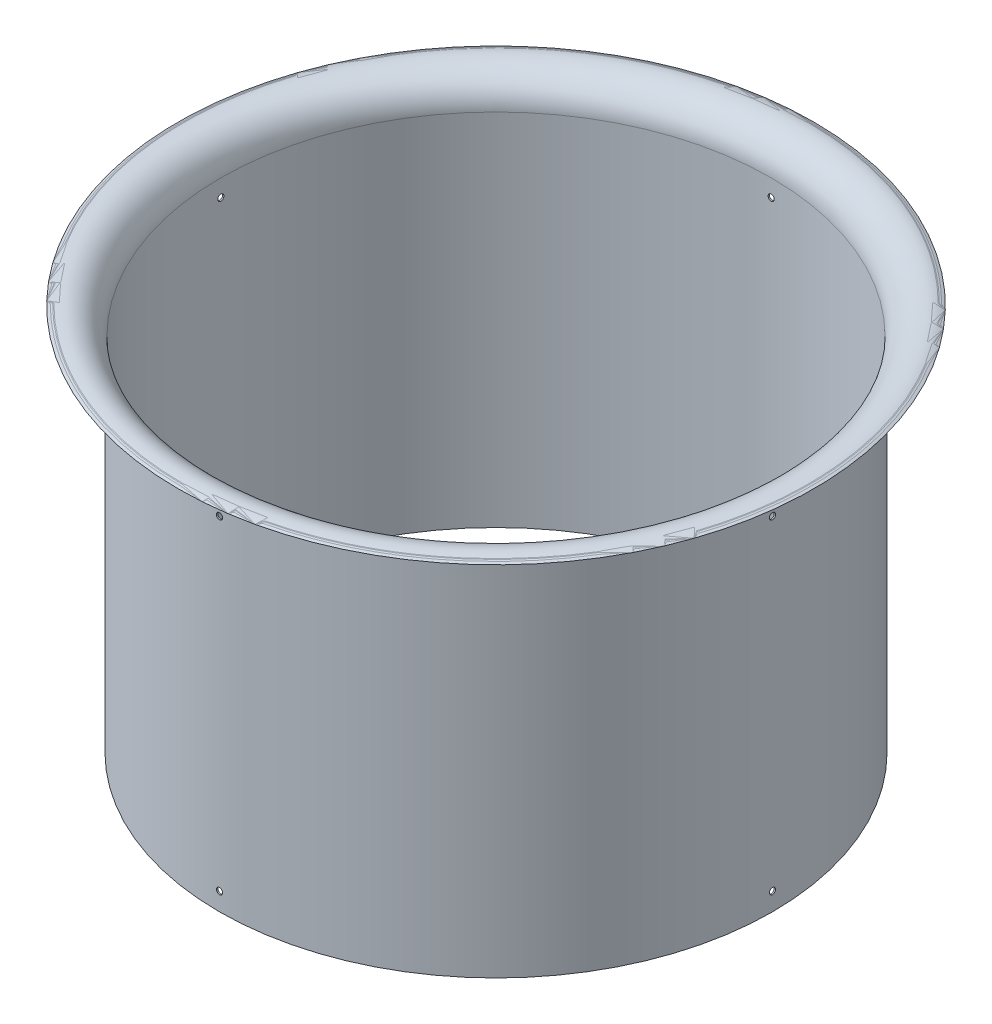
ISO-10303-21;
HEADER;
FILE_DESCRIPTION(('STEP AP214'),'2;1');
FILE_NAME('part.step','',(''),(''),'','','');
FILE_SCHEMA(('AUTOMOTIVE_DESIGN { 1 0 10303 214 1 1 1 1 }'));
ENDSEC;
DATA;
#1=APPLICATION_CONTEXT('core data for automotive mechanical design processes');
#2=APPLICATION_PROTOCOL_DEFINITION('international standard','automotive_design',2000,#1);
#3=PRODUCT_CONTEXT('',#1,'mechanical');
#4=PRODUCT('Part','Part','',(#3));
#5=PRODUCT_RELATED_PRODUCT_CATEGORY('part','',(#4));
#6=PRODUCT_DEFINITION_FORMATION('','',#4);
#7=PRODUCT_DEFINITION_CONTEXT('part definition',#1,'design');
#8=PRODUCT_DEFINITION('design','',#6,#7);
#9=PRODUCT_DEFINITION_SHAPE('','',#8);
#10=(LENGTH_UNIT() NAMED_UNIT(*) SI_UNIT(.MILLI.,.METRE.));
#11=(NAMED_UNIT(*) PLANE_ANGLE_UNIT() SI_UNIT($,.RADIAN.));
#12=(NAMED_UNIT(*) SI_UNIT($,.STERADIAN.) SOLID_ANGLE_UNIT());
#13=UNCERTAINTY_MEASURE_WITH_UNIT(LENGTH_MEASURE(1.E-05),#10,'distance_accuracy_value','');
#14=(GEOMETRIC_REPRESENTATION_CONTEXT(3) GLOBAL_UNCERTAINTY_ASSIGNED_CONTEXT((#13)) GLOBAL_UNIT_ASSIGNED_CONTEXT((#10,
#11,#12)) REPRESENTATION_CONTEXT('',''));
#15=CARTESIAN_POINT('',(0.,0.,0.));
#16=DIRECTION('',(0.,0.,1.));
#17=DIRECTION('',(1.,0.,0.));
#18=AXIS2_PLACEMENT_3D('',#15,#16,#17);
#19=CARTESIAN_POINT('',(-146.05,0.,0.));
#20=DIRECTION('',(0.,1.,0.));
#21=DIRECTION('',(0.,0.,1.));
#22=AXIS2_PLACEMENT_3D('',#19,#20,#21);
#23=PLANE('',#22);
#24=CARTESIAN_POINT('',(0.,0.,0.));
#25=DIRECTION('',(0.,-1.,0.));
#26=DIRECTION('',(0.,0.,-1.));
#27=AXIS2_PLACEMENT_3D('',#24,#25,#26);
#28=CIRCLE('',#27,145.3261);
#29=CARTESIAN_POINT('',(0.,0.,-145.3261));
#30=VERTEX_POINT('',#29);
#31=EDGE_CURVE('E10',#30,#30,#28,.T.);
#32=ORIENTED_EDGE('',*,*,#31,.F.);
#33=EDGE_LOOP('',(#32));
#34=FACE_BOUND('',#33,.T.);
#35=CARTESIAN_POINT('',(0.,0.,0.));
#36=DIRECTION('',(0.,-1.,0.));
#37=DIRECTION('',(0.,0.,-1.));
#38=AXIS2_PLACEMENT_3D('',#35,#36,#37);
#39=CIRCLE('',#38,146.05);
#40=CARTESIAN_POINT('',(0.,0.,-146.05));
#41=VERTEX_POINT('',#40);
#42=EDGE_CURVE('E84',#41,#41,#39,.T.);
#43=ORIENTED_EDGE('',*,*,#42,.T.);
#44=EDGE_LOOP('',(#43));
#45=FACE_BOUND('',#44,.T.);
#46=ADVANCED_FACE('F31',(#34,#45),#23,.F.);
#47=CARTESIAN_POINT('',(0.,0.,0.));
#48=DIRECTION('',(0.,-1.,0.));
#49=DIRECTION('',(0.,0.,-1.));
#50=AXIS2_PLACEMENT_3D('',#47,#48,#49);
#51=CYLINDRICAL_SURFACE('',#50,145.3261);
#52=CARTESIAN_POINT('',(-145.316936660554,180.975,-1.6319500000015));
#53=CARTESIAN_POINT('',(-145.316936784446,180.883335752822,-1.63194593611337));
#54=CARTESIAN_POINT('',(-145.317024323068,180.791605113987,-1.6242011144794));
#55=CARTESIAN_POINT('',(-145.317365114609,180.610670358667,-1.59341307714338));
#56=CARTESIAN_POINT('',(-145.317618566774,180.521469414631,-1.57035146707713));
#57=CARTESIAN_POINT('',(-145.318262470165,180.348241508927,-1.5095866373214));
#58=CARTESIAN_POINT('',(-145.318652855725,180.264212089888,-1.47189043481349));
#59=CARTESIAN_POINT('',(-145.319526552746,180.103698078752,-1.38293617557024));
#60=CARTESIAN_POINT('',(-145.320009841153,180.027211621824,-1.33168148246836));
#61=CARTESIAN_POINT('',(-145.321014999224,179.883916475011,-1.2170524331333));
#62=CARTESIAN_POINT('',(-145.321536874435,179.817109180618,-1.15367633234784));
#63=CARTESIAN_POINT('',(-145.322560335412,179.695080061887,-1.01660519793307));
#64=CARTESIAN_POINT('',(-145.323061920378,179.639858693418,-0.942909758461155));
#65=CARTESIAN_POINT('',(-145.323988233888,179.542571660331,-0.787292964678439));
#66=CARTESIAN_POINT('',(-145.324412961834,179.500506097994,-0.705371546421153));
#67=CARTESIAN_POINT('',(-145.325137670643,179.430725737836,-0.535628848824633));
#68=CARTESIAN_POINT('',(-145.325437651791,179.403010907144,-0.447807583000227));
#69=CARTESIAN_POINT('',(-145.325879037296,179.36271971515,-0.268761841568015));
#70=CARTESIAN_POINT('',(-145.326020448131,179.350142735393,-0.17753750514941));
#71=CARTESIAN_POINT('',(-145.32612877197,179.340482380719,0.00572779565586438));
#72=CARTESIAN_POINT('',(-145.326095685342,179.343398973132,0.0977687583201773));
#73=CARTESIAN_POINT('',(-145.325858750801,179.364642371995,0.280050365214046));
#74=CARTESIAN_POINT('',(-145.325654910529,179.382968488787,0.370291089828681));
#75=CARTESIAN_POINT('',(-145.325099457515,179.434509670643,0.546415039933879));
#76=CARTESIAN_POINT('',(-145.324747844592,179.467724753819,0.632298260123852));
#77=CARTESIAN_POINT('',(-145.323936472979,179.548101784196,0.797271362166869));
#78=CARTESIAN_POINT('',(-145.323476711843,179.595264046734,0.876361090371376));
#79=CARTESIAN_POINT('',(-145.322500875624,179.702196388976,1.02550038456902));
#80=CARTESIAN_POINT('',(-145.321984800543,179.76196646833,1.0955499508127));
#81=CARTESIAN_POINT('',(-145.320954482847,179.892421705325,1.22462451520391));
#82=CARTESIAN_POINT('',(-145.320440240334,179.963107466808,1.28364890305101));
#83=CARTESIAN_POINT('',(-145.319471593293,180.113385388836,1.38899289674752));
#84=CARTESIAN_POINT('',(-145.319017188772,180.192977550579,1.43531250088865));
#85=CARTESIAN_POINT('',(-145.318219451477,180.358809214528,1.51393197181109));
#86=CARTESIAN_POINT('',(-145.317876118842,180.445048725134,1.54623182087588));
#87=CARTESIAN_POINT('',(-145.317339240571,180.621726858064,1.59589450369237));
#88=CARTESIAN_POINT('',(-145.317145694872,180.712165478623,1.61325734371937));
#89=CARTESIAN_POINT('',(-145.316930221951,180.894669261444,1.63255238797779));
#90=CARTESIAN_POINT('',(-145.316908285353,180.986734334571,1.6344854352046));
#91=CARTESIAN_POINT('',(-145.317038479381,181.169882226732,1.62286821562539));
#92=CARTESIAN_POINT('',(-145.317190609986,181.260965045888,1.60931795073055));
#93=CARTESIAN_POINT('',(-145.31765177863,181.439560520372,1.56711945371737));
#94=CARTESIAN_POINT('',(-145.317960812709,181.527073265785,1.53847160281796));
#95=CARTESIAN_POINT('',(-145.318700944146,181.696047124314,1.46689155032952));
#96=CARTESIAN_POINT('',(-145.319132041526,181.777508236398,1.42395934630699));
#97=CARTESIAN_POINT('',(-145.320067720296,181.932070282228,1.32502712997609));
#98=CARTESIAN_POINT('',(-145.320572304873,182.005170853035,1.2690265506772));
#99=CARTESIAN_POINT('',(-145.321598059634,182.140933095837,1.14554808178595));
#100=CARTESIAN_POINT('',(-145.32211922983,182.203594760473,1.07807018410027));
#101=CARTESIAN_POINT('',(-145.323119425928,182.31670320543,0.933548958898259));
#102=CARTESIAN_POINT('',(-145.323598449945,182.367149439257,0.856505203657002));
#103=CARTESIAN_POINT('',(-145.324460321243,182.454391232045,0.695041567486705));
#104=CARTESIAN_POINT('',(-145.324843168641,182.491186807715,0.610621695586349));
#105=CARTESIAN_POINT('',(-145.325469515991,182.550081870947,0.436804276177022));
#106=CARTESIAN_POINT('',(-145.325713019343,182.572181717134,0.34740685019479));
#107=CARTESIAN_POINT('',(-145.326033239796,182.601059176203,0.166170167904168));
#108=CARTESIAN_POINT('',(-145.326109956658,182.60783676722,0.0743309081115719));
#109=CARTESIAN_POINT('',(-145.326087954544,182.605877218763,-0.109176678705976));
#110=CARTESIAN_POINT('',(-145.325989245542,182.597140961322,-0.200845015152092));
#111=CARTESIAN_POINT('',(-145.325627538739,182.564403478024,-0.3814139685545));
#112=CARTESIAN_POINT('',(-145.325364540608,182.540402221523,-0.470314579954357));
#113=CARTESIAN_POINT('',(-145.3247038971,182.477815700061,-0.642826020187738));
#114=CARTESIAN_POINT('',(-145.324306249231,182.439230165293,-0.726436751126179));
#115=CARTESIAN_POINT('',(-145.323421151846,182.348572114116,-0.885990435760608));
#116=CARTESIAN_POINT('',(-145.322933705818,182.296500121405,-0.961933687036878));
#117=CARTESIAN_POINT('',(-145.321923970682,182.180350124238,-1.10399734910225));
#118=CARTESIAN_POINT('',(-145.321401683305,182.116272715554,-1.17011824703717));
#119=CARTESIAN_POINT('',(-145.320380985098,181.97790802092,-1.290680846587));
#120=CARTESIAN_POINT('',(-145.319882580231,181.903618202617,-1.34511964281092));
#121=CARTESIAN_POINT('',(-145.318965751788,181.746922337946,-1.44077430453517));
#122=CARTESIAN_POINT('',(-145.318547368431,181.6645122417,-1.48198352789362));
#123=CARTESIAN_POINT('',(-145.317838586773,181.494007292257,-1.5499339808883));
#124=CARTESIAN_POINT('',(-145.317548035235,181.405919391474,-1.5766925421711));
#125=CARTESIAN_POINT('',(-145.31720570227,181.260225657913,-1.60785600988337));
#126=CARTESIAN_POINT('',(-145.317105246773,181.203566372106,-1.61687996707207));
#127=CARTESIAN_POINT('',(-145.31697068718,181.089613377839,-1.6289282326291));
#128=CARTESIAN_POINT('',(-145.316936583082,181.032319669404,-1.63195254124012));
#129=CARTESIAN_POINT('',(-145.316936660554,180.975,-1.6319500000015));
#130=B_SPLINE_CURVE_WITH_KNOTS('',3,(#52,#53,#54,#55,#56,#57,#58,#59,#60,#61,#62,#63,#64,#65,
#66,#67,#68,#69,#70,#71,#72,#73,#74,#75,#76,#77,#78,#79,#80,#81,#82,#83,#84,#85,#86,#87,#88,#89,
#90,#91,#92,#93,#94,#95,#96,#97,#98,#99,#100,#101,#102,#103,#104,#105,#106,#107,#108,#109,#110,
#111,#112,#113,#114,#115,#116,#117,#118,#119,#120,#121,#122,#123,#124,#125,#126,#127,#128,#129),
.UNSPECIFIED.,.T.,.F.,(4,2,2,2,2,2,2,2,2,2,2,2,2,2,2,2,2,2,2,2,2,2,2,2,2,2,2,2,2,2,2,2,2,2,2,2,
2,2,4),(0.,0.274783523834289,0.549897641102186,0.824880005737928,1.09979421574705,
1.37474802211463,1.64971264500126,1.92467940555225,2.19964553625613,2.4746004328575,
2.74955474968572,3.02449676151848,3.29943910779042,3.57438767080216,3.84933622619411,
4.12429999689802,4.39926380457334,4.67422795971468,4.94919199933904,5.22414101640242,
5.49908999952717,5.7740320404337,6.04897412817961,6.32392814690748,6.5988823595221,
6.87384887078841,7.14881504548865,7.42377450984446,7.6987343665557,7.9736785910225,
8.24862336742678,8.52357323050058,8.79851241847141,9.0734379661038,9.34843180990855,
9.62356350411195,9.89836447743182,10.0701926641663,10.2420208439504),.UNSPECIFIED.);
#131=CARTESIAN_POINT('',(-145.316936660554,180.975,-1.6319500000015));
#132=VERTEX_POINT('',#131);
#133=EDGE_CURVE('E34',#132,#132,#130,.T.);
#134=ORIENTED_EDGE('',*,*,#133,.T.);
#135=EDGE_LOOP('',(#134));
#136=FACE_BOUND('',#135,.T.);
#137=CARTESIAN_POINT('',(-145.316936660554,9.525,-1.6319500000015));
#138=CARTESIAN_POINT('',(-145.316936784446,9.43333575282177,-1.63194593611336));
#139=CARTESIAN_POINT('',(-145.317024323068,9.34160511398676,-1.6242011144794));
#140=CARTESIAN_POINT('',(-145.317365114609,9.16067035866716,-1.59341307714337));
#141=CARTESIAN_POINT('',(-145.317618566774,9.07146941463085,-1.57035146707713));
#142=CARTESIAN_POINT('',(-145.318262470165,8.8982415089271,-1.50958663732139));
#143=CARTESIAN_POINT('',(-145.318652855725,8.81421208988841,-1.47189043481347));
#144=CARTESIAN_POINT('',(-145.319526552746,8.65369807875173,-1.38293617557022));
#145=CARTESIAN_POINT('',(-145.320009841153,8.57721162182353,-1.33168148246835));
#146=CARTESIAN_POINT('',(-145.321014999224,8.43391647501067,-1.2170524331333));
#147=CARTESIAN_POINT('',(-145.321536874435,8.36710918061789,-1.15367633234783));
#148=CARTESIAN_POINT('',(-145.322560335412,8.24508006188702,-1.01660519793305));
#149=CARTESIAN_POINT('',(-145.323061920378,8.18985869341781,-0.942909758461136));
#150=CARTESIAN_POINT('',(-145.323988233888,8.09257166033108,-0.787292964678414));
#151=CARTESIAN_POINT('',(-145.324412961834,8.05050609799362,-0.705371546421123));
#152=CARTESIAN_POINT('',(-145.325137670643,7.98072573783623,-0.5356288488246));
#153=CARTESIAN_POINT('',(-145.325437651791,7.95301090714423,-0.447807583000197));
#154=CARTESIAN_POINT('',(-145.325879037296,7.91271971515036,-0.268761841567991));
#155=CARTESIAN_POINT('',(-145.326020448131,7.90014273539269,-0.177537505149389));
#156=CARTESIAN_POINT('',(-145.32612877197,7.8904823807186,0.00572779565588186));
#157=CARTESIAN_POINT('',(-145.326095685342,7.89339897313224,0.0977687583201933));
#158=CARTESIAN_POINT('',(-145.325858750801,7.91464237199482,0.280050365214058));
#159=CARTESIAN_POINT('',(-145.325654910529,7.93296848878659,0.370291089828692));
#160=CARTESIAN_POINT('',(-145.325099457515,7.98450967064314,0.546415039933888));
#161=CARTESIAN_POINT('',(-145.324747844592,8.01772475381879,0.63229826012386));
#162=CARTESIAN_POINT('',(-145.323936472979,8.0981017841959,0.797271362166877));
#163=CARTESIAN_POINT('',(-145.323476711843,8.14526404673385,0.876361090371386));
#164=CARTESIAN_POINT('',(-145.322500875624,8.25219638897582,1.02550038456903));
#165=CARTESIAN_POINT('',(-145.321984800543,8.31196646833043,1.09554995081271));
#166=CARTESIAN_POINT('',(-145.320954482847,8.44242170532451,1.22462451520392));
#167=CARTESIAN_POINT('',(-145.320440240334,8.51310746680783,1.28364890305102));
#168=CARTESIAN_POINT('',(-145.319471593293,8.66338538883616,1.38899289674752));
#169=CARTESIAN_POINT('',(-145.319017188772,8.74297755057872,1.43531250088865));
#170=CARTESIAN_POINT('',(-145.318219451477,8.90880921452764,1.51393197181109));
#171=CARTESIAN_POINT('',(-145.317876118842,8.99504872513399,1.54623182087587));
#172=CARTESIAN_POINT('',(-145.317339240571,9.1717268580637,1.59589450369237));
#173=CARTESIAN_POINT('',(-145.317145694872,9.26216547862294,1.61325734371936));
#174=CARTESIAN_POINT('',(-145.316930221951,9.4446692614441,1.63255238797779));
#175=CARTESIAN_POINT('',(-145.316908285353,9.53673433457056,1.6344854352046));
#176=CARTESIAN_POINT('',(-145.317038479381,9.71988222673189,1.62286821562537));
#177=CARTESIAN_POINT('',(-145.317190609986,9.81096504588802,1.60931795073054));
#178=CARTESIAN_POINT('',(-145.317651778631,9.98956052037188,1.56711945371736));
#179=CARTESIAN_POINT('',(-145.317960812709,10.077073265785,1.53847160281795));
#180=CARTESIAN_POINT('',(-145.318700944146,10.2460471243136,1.46689155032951));
#181=CARTESIAN_POINT('',(-145.319132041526,10.3275082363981,1.42395934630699));
#182=CARTESIAN_POINT('',(-145.320067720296,10.4820702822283,1.3250271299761));
#183=CARTESIAN_POINT('',(-145.320572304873,10.5551708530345,1.2690265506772));
#184=CARTESIAN_POINT('',(-145.321598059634,10.6909330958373,1.14554808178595));
#185=CARTESIAN_POINT('',(-145.32211922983,10.7535947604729,1.07807018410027));
#186=CARTESIAN_POINT('',(-145.323119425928,10.8667032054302,0.933548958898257));
#187=CARTESIAN_POINT('',(-145.323598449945,10.9171494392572,0.856505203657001));
#188=CARTESIAN_POINT('',(-145.324460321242,11.0043912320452,0.695041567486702));
#189=CARTESIAN_POINT('',(-145.324843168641,11.0411868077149,0.610621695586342));
#190=CARTESIAN_POINT('',(-145.325469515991,11.1000818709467,0.436804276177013));
#191=CARTESIAN_POINT('',(-145.325713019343,11.1221817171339,0.347406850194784));
#192=CARTESIAN_POINT('',(-145.326033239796,11.1510591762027,0.166170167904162));
#193=CARTESIAN_POINT('',(-145.326109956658,11.15783676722,0.0743309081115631));
#194=CARTESIAN_POINT('',(-145.326087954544,11.1558772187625,-0.109176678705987));
#195=CARTESIAN_POINT('',(-145.325989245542,11.1471409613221,-0.200845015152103));
#196=CARTESIAN_POINT('',(-145.325627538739,11.1144034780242,-0.38141396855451));
#197=CARTESIAN_POINT('',(-145.325364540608,11.090402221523,-0.470314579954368));
#198=CARTESIAN_POINT('',(-145.3247038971,11.0278157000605,-0.642826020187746));
#199=CARTESIAN_POINT('',(-145.324306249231,10.9892301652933,-0.726436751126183));
#200=CARTESIAN_POINT('',(-145.323421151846,10.8985721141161,-0.885990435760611));
#201=CARTESIAN_POINT('',(-145.322933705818,10.846500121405,-0.961933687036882));
#202=CARTESIAN_POINT('',(-145.321923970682,10.7303501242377,-1.10399734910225));
#203=CARTESIAN_POINT('',(-145.321401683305,10.6662727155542,-1.17011824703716));
#204=CARTESIAN_POINT('',(-145.320380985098,10.52790802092,-1.29068084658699));
#205=CARTESIAN_POINT('',(-145.319882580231,10.4536182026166,-1.34511964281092));
#206=CARTESIAN_POINT('',(-145.318965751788,10.2969223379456,-1.44077430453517));
#207=CARTESIAN_POINT('',(-145.318547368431,10.2145122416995,-1.48198352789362));
#208=CARTESIAN_POINT('',(-145.317838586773,10.0440072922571,-1.54993398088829));
#209=CARTESIAN_POINT('',(-145.317548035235,9.95591939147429,-1.57669254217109));
#210=CARTESIAN_POINT('',(-145.31720570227,9.81022565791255,-1.60785600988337));
#211=CARTESIAN_POINT('',(-145.317105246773,9.75356637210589,-1.61687996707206));
#212=CARTESIAN_POINT('',(-145.31697068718,9.6396133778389,-1.62892823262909));
#213=CARTESIAN_POINT('',(-145.316936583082,9.58231966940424,-1.63195254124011));
#214=CARTESIAN_POINT('',(-145.316936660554,9.525,-1.6319500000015));
#215=B_SPLINE_CURVE_WITH_KNOTS('',3,(#137,#138,#139,#140,#141,#142,#143,#144,#145,#146,#147,
#148,#149,#150,#151,#152,#153,#154,#155,#156,#157,#158,#159,#160,#161,#162,#163,#164,#165,#166,
#167,#168,#169,#170,#171,#172,#173,#174,#175,#176,#177,#178,#179,#180,#181,#182,#183,#184,#185,
#186,#187,#188,#189,#190,#191,#192,#193,#194,#195,#196,#197,#198,#199,#200,#201,#202,#203,#204,
#205,#206,#207,#208,#209,#210,#211,#212,#213,#214),.UNSPECIFIED.,.T.,.F.,(4,2,2,2,2,2,2,2,2,2,2,
2,2,2,2,2,2,2,2,2,2,2,2,2,2,2,2,2,2,2,2,2,2,2,2,2,2,2,4),(0.,0.27478352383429,0.549897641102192,
0.824880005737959,1.09979421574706,1.37474802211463,1.64971264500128,1.92467940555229,
2.19964553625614,2.47460043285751,2.74955474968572,3.02449676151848,3.29943910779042,
3.57438767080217,3.84933622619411,4.12429999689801,4.39926380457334,4.67422795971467,
4.94919199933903,5.22414101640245,5.49908999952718,5.77403204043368,6.04897412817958,
6.32392814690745,6.59888235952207,6.87384887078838,7.14881504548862,7.42377450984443,
7.69873436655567,7.97367859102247,8.24862336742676,8.52357323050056,8.79851241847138,
9.07343796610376,9.34843180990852,9.62356350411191,9.89836447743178,10.0701926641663,
10.2420208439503),.UNSPECIFIED.);
#216=CARTESIAN_POINT('',(-145.316936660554,9.525,-1.6319500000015));
#217=VERTEX_POINT('',#216);
#218=EDGE_CURVE('E114',#217,#217,#215,.T.);
#219=ORIENTED_EDGE('',*,*,#218,.T.);
#220=EDGE_LOOP('',(#219));
#221=FACE_BOUND('',#220,.T.);
#222=CARTESIAN_POINT('',(-1.63194999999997,180.975,145.316936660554));
#223=CARTESIAN_POINT('',(-1.63194593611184,180.883335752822,145.316936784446));
#224=CARTESIAN_POINT('',(-1.62420111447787,180.791605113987,145.317024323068));
#225=CARTESIAN_POINT('',(-1.59341307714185,180.610670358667,145.317365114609));
#226=CARTESIAN_POINT('',(-1.5703514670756,180.521469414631,145.317618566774));
#227=CARTESIAN_POINT('',(-1.50958663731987,180.348241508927,145.318262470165));
#228=CARTESIAN_POINT('',(-1.47189043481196,180.264212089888,145.318652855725));
#229=CARTESIAN_POINT('',(-1.38293617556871,180.103698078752,145.319526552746));
#230=CARTESIAN_POINT('',(-1.33168148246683,180.027211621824,145.320009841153));
#231=CARTESIAN_POINT('',(-1.21705243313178,179.883916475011,145.321014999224));
#232=CARTESIAN_POINT('',(-1.15367633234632,179.817109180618,145.321536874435));
#233=CARTESIAN_POINT('',(-1.01660519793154,179.695080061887,145.322560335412));
#234=CARTESIAN_POINT('',(-0.942909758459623,179.639858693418,145.323061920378));
#235=CARTESIAN_POINT('',(-0.787292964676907,179.542571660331,145.323988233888));
#236=CARTESIAN_POINT('',(-0.705371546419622,179.500506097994,145.324412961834));
#237=CARTESIAN_POINT('',(-0.5356288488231,179.430725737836,145.325137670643));
#238=CARTESIAN_POINT('',(-0.447807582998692,179.403010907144,145.325437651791));
#239=CARTESIAN_POINT('',(-0.268761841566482,179.36271971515,145.325879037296));
#240=CARTESIAN_POINT('',(-0.177537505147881,179.350142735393,145.326020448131));
#241=CARTESIAN_POINT('',(0.00572779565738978,179.340482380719,145.32612877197));
#242=CARTESIAN_POINT('',(0.0977687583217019,179.343398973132,145.326095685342));
#243=CARTESIAN_POINT('',(0.280050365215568,179.364642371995,145.325858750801));
#244=CARTESIAN_POINT('',(0.370291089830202,179.382968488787,145.325654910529));
#245=CARTESIAN_POINT('',(0.5464150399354,179.434509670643,145.325099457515));
#246=CARTESIAN_POINT('',(0.632298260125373,179.467724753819,145.324747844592));
#247=CARTESIAN_POINT('',(0.797271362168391,179.548101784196,145.323936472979));
#248=CARTESIAN_POINT('',(0.876361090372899,179.595264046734,145.323476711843));
#249=CARTESIAN_POINT('',(1.02550038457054,179.702196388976,145.322500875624));
#250=CARTESIAN_POINT('',(1.09554995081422,179.76196646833,145.321984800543));
#251=CARTESIAN_POINT('',(1.22462451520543,179.892421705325,145.320954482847));
#252=CARTESIAN_POINT('',(1.28364890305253,179.963107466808,145.320440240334));
#253=CARTESIAN_POINT('',(1.38899289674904,180.113385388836,145.319471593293));
#254=CARTESIAN_POINT('',(1.43531250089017,180.192977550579,145.319017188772));
#255=CARTESIAN_POINT('',(1.51393197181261,180.358809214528,145.318219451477));
#256=CARTESIAN_POINT('',(1.5462318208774,180.445048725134,145.317876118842));
#257=CARTESIAN_POINT('',(1.59589450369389,180.621726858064,145.317339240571));
#258=CARTESIAN_POINT('',(1.61325734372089,180.712165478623,145.317145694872));
#259=CARTESIAN_POINT('',(1.63255238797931,180.894669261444,145.316930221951));
#260=CARTESIAN_POINT('',(1.63448543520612,180.986734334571,145.316908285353));
#261=CARTESIAN_POINT('',(1.6228682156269,181.169882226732,145.317038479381));
#262=CARTESIAN_POINT('',(1.60931795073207,181.260965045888,145.317190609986));
#263=CARTESIAN_POINT('',(1.56711945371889,181.439560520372,145.31765177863));
#264=CARTESIAN_POINT('',(1.53847160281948,181.527073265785,145.317960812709));
#265=CARTESIAN_POINT('',(1.46689155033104,181.696047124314,145.318700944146));
#266=CARTESIAN_POINT('',(1.42395934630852,181.777508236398,145.319132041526));
#267=CARTESIAN_POINT('',(1.32502712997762,181.932070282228,145.320067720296));
#268=CARTESIAN_POINT('',(1.26902655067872,182.005170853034,145.320572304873));
#269=CARTESIAN_POINT('',(1.14554808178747,182.140933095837,145.321598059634));
#270=CARTESIAN_POINT('',(1.07807018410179,182.203594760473,145.32211922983));
#271=CARTESIAN_POINT('',(0.933548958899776,182.31670320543,145.323119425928));
#272=CARTESIAN_POINT('',(0.856505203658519,182.367149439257,145.323598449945));
#273=CARTESIAN_POINT('',(0.695041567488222,182.454391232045,145.324460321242));
#274=CARTESIAN_POINT('',(0.610621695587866,182.491186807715,145.324843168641));
#275=CARTESIAN_POINT('',(0.436804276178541,182.550081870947,145.325469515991));
#276=CARTESIAN_POINT('',(0.347406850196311,182.572181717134,145.325713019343));
#277=CARTESIAN_POINT('',(0.166170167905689,182.601059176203,145.326033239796));
#278=CARTESIAN_POINT('',(0.074330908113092,182.60783676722,145.326109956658));
#279=CARTESIAN_POINT('',(-0.109176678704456,182.605877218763,145.326087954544));
#280=CARTESIAN_POINT('',(-0.200845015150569,182.597140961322,145.325989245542));
#281=CARTESIAN_POINT('',(-0.381413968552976,182.564403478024,145.325627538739));
#282=CARTESIAN_POINT('',(-0.470314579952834,182.540402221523,145.325364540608));
#283=CARTESIAN_POINT('',(-0.642826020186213,182.477815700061,145.3247038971));
#284=CARTESIAN_POINT('',(-0.726436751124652,182.439230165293,145.324306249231));
#285=CARTESIAN_POINT('',(-0.88599043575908,182.348572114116,145.323421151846));
#286=CARTESIAN_POINT('',(-0.961933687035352,182.296500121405,145.322933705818));
#287=CARTESIAN_POINT('',(-1.10399734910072,182.180350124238,145.321923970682));
#288=CARTESIAN_POINT('',(-1.17011824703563,182.116272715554,145.321401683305));
#289=CARTESIAN_POINT('',(-1.29068084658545,181.97790802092,145.320380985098));
#290=CARTESIAN_POINT('',(-1.34511964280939,181.903618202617,145.319882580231));
#291=CARTESIAN_POINT('',(-1.44077430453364,181.746922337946,145.318965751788));
#292=CARTESIAN_POINT('',(-1.48198352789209,181.6645122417,145.318547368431));
#293=CARTESIAN_POINT('',(-1.54993398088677,181.494007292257,145.317838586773));
#294=CARTESIAN_POINT('',(-1.57669254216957,181.405919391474,145.317548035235));
#295=CARTESIAN_POINT('',(-1.60785600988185,181.260225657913,145.31720570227));
#296=CARTESIAN_POINT('',(-1.61687996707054,181.203566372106,145.317105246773));
#297=CARTESIAN_POINT('',(-1.62892823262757,181.089613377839,145.31697068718));
#298=CARTESIAN_POINT('',(-1.63195254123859,181.032319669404,145.316936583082));
#299=CARTESIAN_POINT('',(-1.63194999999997,180.975,145.316936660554));
#300=B_SPLINE_CURVE_WITH_KNOTS('',3,(#222,#223,#224,#225,#226,#227,#228,#229,#230,#231,#232,
#233,#234,#235,#236,#237,#238,#239,#240,#241,#242,#243,#244,#245,#246,#247,#248,#249,#250,#251,
#252,#253,#254,#255,#256,#257,#258,#259,#260,#261,#262,#263,#264,#265,#266,#267,#268,#269,#270,
#271,#272,#273,#274,#275,#276,#277,#278,#279,#280,#281,#282,#283,#284,#285,#286,#287,#288,#289,
#290,#291,#292,#293,#294,#295,#296,#297,#298,#299),.UNSPECIFIED.,.T.,.F.,(4,2,2,2,2,2,2,2,2,2,2,
2,2,2,2,2,2,2,2,2,2,2,2,2,2,2,2,2,2,2,2,2,2,2,2,2,2,2,4),(0.,0.274783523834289,
0.549897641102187,0.824880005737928,1.09979421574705,1.37474802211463,1.64971264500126,
1.92467940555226,2.19964553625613,2.47460043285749,2.74955474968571,3.02449676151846,
3.2994391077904,3.57438767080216,3.84933622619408,4.12429999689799,4.39926380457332,
4.67422795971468,4.94919199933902,5.22414101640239,5.49908999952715,5.77403204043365,
6.04897412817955,6.32392814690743,6.59888235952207,6.87384887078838,7.14881504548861,
7.42377450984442,7.69873436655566,7.97367859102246,8.24862336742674,8.52357323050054,
8.79851241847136,9.07343796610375,9.3484318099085,9.6235635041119,9.89836447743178,
10.0701926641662,10.2420208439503),.UNSPECIFIED.);
#301=CARTESIAN_POINT('',(-1.63194999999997,180.975,145.316936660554));
#302=VERTEX_POINT('',#301);
#303=EDGE_CURVE('E118',#302,#302,#300,.T.);
#304=ORIENTED_EDGE('',*,*,#303,.T.);
#305=EDGE_LOOP('',(#304));
#306=FACE_BOUND('',#305,.T.);
#307=CARTESIAN_POINT('',(-1.63194999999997,9.525,145.316936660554));
#308=CARTESIAN_POINT('',(-1.63194593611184,9.43333575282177,145.316936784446));
#309=CARTESIAN_POINT('',(-1.62420111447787,9.34160511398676,145.317024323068));
#310=CARTESIAN_POINT('',(-1.59341307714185,9.16067035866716,145.317365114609));
#311=CARTESIAN_POINT('',(-1.5703514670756,9.07146941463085,145.317618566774));
#312=CARTESIAN_POINT('',(-1.50958663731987,8.8982415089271,145.318262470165));
#313=CARTESIAN_POINT('',(-1.47189043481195,8.81421208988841,145.318652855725));
#314=CARTESIAN_POINT('',(-1.3829361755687,8.65369807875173,145.319526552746));
#315=CARTESIAN_POINT('',(-1.33168148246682,8.57721162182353,145.320009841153));
#316=CARTESIAN_POINT('',(-1.21705243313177,8.43391647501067,145.321014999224));
#317=CARTESIAN_POINT('',(-1.15367633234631,8.36710918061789,145.321536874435));
#318=CARTESIAN_POINT('',(-1.01660519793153,8.24508006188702,145.322560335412));
#319=CARTESIAN_POINT('',(-0.942909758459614,8.18985869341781,145.323061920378));
#320=CARTESIAN_POINT('',(-0.787292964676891,8.09257166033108,145.323988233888));
#321=CARTESIAN_POINT('',(-0.705371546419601,8.05050609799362,145.324412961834));
#322=CARTESIAN_POINT('',(-0.535628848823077,7.98072573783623,145.325137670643));
#323=CARTESIAN_POINT('',(-0.447807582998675,7.95301090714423,145.325437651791));
#324=CARTESIAN_POINT('',(-0.268761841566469,7.91271971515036,145.325879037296));
#325=CARTESIAN_POINT('',(-0.177537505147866,7.90014273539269,145.326020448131));
#326=CARTESIAN_POINT('',(0.00572779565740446,7.8904823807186,145.32612877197));
#327=CARTESIAN_POINT('',(0.0977687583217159,7.89339897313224,145.326095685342));
#328=CARTESIAN_POINT('',(0.280050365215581,7.91464237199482,145.325858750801));
#329=CARTESIAN_POINT('',(0.370291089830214,7.93296848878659,145.325654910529));
#330=CARTESIAN_POINT('',(0.546415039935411,7.98450967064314,145.325099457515));
#331=CARTESIAN_POINT('',(0.632298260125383,8.01772475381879,145.324747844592));
#332=CARTESIAN_POINT('',(0.7972713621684,8.0981017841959,145.323936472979));
#333=CARTESIAN_POINT('',(0.876361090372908,8.14526404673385,145.323476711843));
#334=CARTESIAN_POINT('',(1.02550038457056,8.25219638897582,145.322500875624));
#335=CARTESIAN_POINT('',(1.09554995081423,8.31196646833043,145.321984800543));
#336=CARTESIAN_POINT('',(1.22462451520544,8.44242170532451,145.320954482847));
#337=CARTESIAN_POINT('',(1.28364890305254,8.51310746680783,145.320440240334));
#338=CARTESIAN_POINT('',(1.38899289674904,8.66338538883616,145.319471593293));
#339=CARTESIAN_POINT('',(1.43531250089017,8.74297755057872,145.319017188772));
#340=CARTESIAN_POINT('',(1.51393197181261,8.90880921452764,145.318219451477));
#341=CARTESIAN_POINT('',(1.5462318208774,8.99504872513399,145.317876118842));
#342=CARTESIAN_POINT('',(1.59589450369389,9.1717268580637,145.317339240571));
#343=CARTESIAN_POINT('',(1.61325734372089,9.26216547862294,145.317145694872));
#344=CARTESIAN_POINT('',(1.63255238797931,9.4446692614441,145.316930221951));
#345=CARTESIAN_POINT('',(1.63448543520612,9.53673433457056,145.316908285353));
#346=CARTESIAN_POINT('',(1.6228682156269,9.71988222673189,145.317038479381));
#347=CARTESIAN_POINT('',(1.60931795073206,9.81096504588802,145.317190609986));
#348=CARTESIAN_POINT('',(1.56711945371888,9.98956052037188,145.317651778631));
#349=CARTESIAN_POINT('',(1.53847160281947,10.077073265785,145.317960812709));
#350=CARTESIAN_POINT('',(1.46689155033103,10.2460471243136,145.318700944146));
#351=CARTESIAN_POINT('',(1.42395934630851,10.3275082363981,145.319132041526));
#352=CARTESIAN_POINT('',(1.32502712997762,10.4820702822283,145.320067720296));
#353=CARTESIAN_POINT('',(1.26902655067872,10.5551708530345,145.320572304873));
#354=CARTESIAN_POINT('',(1.14554808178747,10.6909330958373,145.321598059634));
#355=CARTESIAN_POINT('',(1.07807018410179,10.7535947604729,145.32211922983));
#356=CARTESIAN_POINT('',(0.93354895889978,10.8667032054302,145.323119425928));
#357=CARTESIAN_POINT('',(0.856505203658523,10.9171494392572,145.323598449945));
#358=CARTESIAN_POINT('',(0.695041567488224,11.0043912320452,145.324460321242));
#359=CARTESIAN_POINT('',(0.610621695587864,11.0411868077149,145.324843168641));
#360=CARTESIAN_POINT('',(0.436804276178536,11.1000818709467,145.325469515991));
#361=CARTESIAN_POINT('',(0.347406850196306,11.1221817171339,145.325713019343));
#362=CARTESIAN_POINT('',(0.166170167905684,11.1510591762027,145.326033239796));
#363=CARTESIAN_POINT('',(0.0743309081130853,11.15783676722,145.326109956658));
#364=CARTESIAN_POINT('',(-0.109176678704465,11.1558772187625,145.326087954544));
#365=CARTESIAN_POINT('',(-0.20084501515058,11.1471409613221,145.325989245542));
#366=CARTESIAN_POINT('',(-0.381413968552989,11.1144034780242,145.325627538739));
#367=CARTESIAN_POINT('',(-0.470314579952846,11.090402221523,145.325364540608));
#368=CARTESIAN_POINT('',(-0.642826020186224,11.0278157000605,145.3247038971));
#369=CARTESIAN_POINT('',(-0.726436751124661,10.9892301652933,145.324306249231));
#370=CARTESIAN_POINT('',(-0.885990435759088,10.8985721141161,145.323421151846));
#371=CARTESIAN_POINT('',(-0.96193368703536,10.846500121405,145.322933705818));
#372=CARTESIAN_POINT('',(-1.10399734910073,10.7303501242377,145.321923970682));
#373=CARTESIAN_POINT('',(-1.17011824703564,10.6662727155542,145.321401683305));
#374=CARTESIAN_POINT('',(-1.29068084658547,10.52790802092,145.320380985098));
#375=CARTESIAN_POINT('',(-1.3451196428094,10.4536182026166,145.319882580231));
#376=CARTESIAN_POINT('',(-1.44077430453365,10.2969223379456,145.318965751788));
#377=CARTESIAN_POINT('',(-1.48198352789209,10.2145122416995,145.318547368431));
#378=CARTESIAN_POINT('',(-1.54993398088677,10.0440072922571,145.317838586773));
#379=CARTESIAN_POINT('',(-1.57669254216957,9.95591939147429,145.317548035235));
#380=CARTESIAN_POINT('',(-1.60785600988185,9.81022565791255,145.31720570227));
#381=CARTESIAN_POINT('',(-1.61687996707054,9.75356637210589,145.317105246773));
#382=CARTESIAN_POINT('',(-1.62892823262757,9.6396133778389,145.31697068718));
#383=CARTESIAN_POINT('',(-1.63195254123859,9.58231966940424,145.316936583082));
#384=CARTESIAN_POINT('',(-1.63194999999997,9.525,145.316936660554));
#385=B_SPLINE_CURVE_WITH_KNOTS('',3,(#307,#308,#309,#310,#311,#312,#313,#314,#315,#316,#317,
#318,#319,#320,#321,#322,#323,#324,#325,#326,#327,#328,#329,#330,#331,#332,#333,#334,#335,#336,
#337,#338,#339,#340,#341,#342,#343,#344,#345,#346,#347,#348,#349,#350,#351,#352,#353,#354,#355,
#356,#357,#358,#359,#360,#361,#362,#363,#364,#365,#366,#367,#368,#369,#370,#371,#372,#373,#374,
#375,#376,#377,#378,#379,#380,#381,#382,#383,#384),.UNSPECIFIED.,.T.,.F.,(4,2,2,2,2,2,2,2,2,2,2,
2,2,2,2,2,2,2,2,2,2,2,2,2,2,2,2,2,2,2,2,2,2,2,2,2,2,2,4),(0.,0.27478352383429,0.549897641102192,
0.824880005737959,1.09979421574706,1.37474802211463,1.64971264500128,1.92467940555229,
2.19964553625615,2.47460043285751,2.74955474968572,3.02449676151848,3.29943910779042,
3.57438767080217,3.84933622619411,4.12429999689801,4.39926380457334,4.67422795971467,
4.94919199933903,5.22414101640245,5.49908999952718,5.77403204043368,6.04897412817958,
6.32392814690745,6.59888235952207,6.87384887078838,7.14881504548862,7.42377450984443,
7.69873436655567,7.97367859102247,8.24862336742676,8.52357323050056,8.79851241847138,
9.07343796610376,9.34843180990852,9.62356350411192,9.89836447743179,10.0701926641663,
10.2420208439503),.UNSPECIFIED.);
#386=CARTESIAN_POINT('',(-1.63194999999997,9.525,145.316936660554));
#387=VERTEX_POINT('',#386);
#388=EDGE_CURVE('E122',#387,#387,#385,.T.);
#389=ORIENTED_EDGE('',*,*,#388,.T.);
#390=EDGE_LOOP('',(#389));
#391=FACE_BOUND('',#390,.T.);
#392=CARTESIAN_POINT('',(145.316936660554,180.975,1.63195000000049));
#393=CARTESIAN_POINT('',(145.316936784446,180.883335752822,1.63194593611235));
#394=CARTESIAN_POINT('',(145.317024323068,180.791605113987,1.62420111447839));
#395=CARTESIAN_POINT('',(145.317365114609,180.610670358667,1.59341307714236));
#396=CARTESIAN_POINT('',(145.317618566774,180.521469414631,1.57035146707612));
#397=CARTESIAN_POINT('',(145.318262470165,180.348241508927,1.50958663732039));
#398=CARTESIAN_POINT('',(145.318652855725,180.264212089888,1.47189043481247));
#399=CARTESIAN_POINT('',(145.319526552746,180.103698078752,1.38293617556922));
#400=CARTESIAN_POINT('',(145.320009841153,180.027211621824,1.33168148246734));
#401=CARTESIAN_POINT('',(145.321014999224,179.883916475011,1.21705243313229));
#402=CARTESIAN_POINT('',(145.321536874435,179.817109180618,1.15367633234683));
#403=CARTESIAN_POINT('',(145.322560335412,179.695080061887,1.01660519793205));
#404=CARTESIAN_POINT('',(145.323061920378,179.639858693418,0.94290975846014));
#405=CARTESIAN_POINT('',(145.323988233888,179.542571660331,0.787292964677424));
#406=CARTESIAN_POINT('',(145.324412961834,179.500506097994,0.705371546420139));
#407=CARTESIAN_POINT('',(145.325137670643,179.430725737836,0.535628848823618));
#408=CARTESIAN_POINT('',(145.325437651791,179.403010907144,0.447807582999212));
#409=CARTESIAN_POINT('',(145.325879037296,179.36271971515,0.268761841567));
#410=CARTESIAN_POINT('',(145.326020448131,179.350142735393,0.177537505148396));
#411=CARTESIAN_POINT('',(145.32612877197,179.340482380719,-0.00572779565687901));
#412=CARTESIAN_POINT('',(145.326095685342,179.343398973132,-0.097768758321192));
#413=CARTESIAN_POINT('',(145.325858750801,179.364642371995,-0.28005036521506));
#414=CARTESIAN_POINT('',(145.325654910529,179.382968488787,-0.370291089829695));
#415=CARTESIAN_POINT('',(145.325099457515,179.434509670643,-0.546415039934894));
#416=CARTESIAN_POINT('',(145.324747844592,179.467724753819,-0.632298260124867));
#417=CARTESIAN_POINT('',(145.323936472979,179.548101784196,-0.797271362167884));
#418=CARTESIAN_POINT('',(145.323476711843,179.595264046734,-0.876361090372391));
#419=CARTESIAN_POINT('',(145.322500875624,179.702196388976,-1.02550038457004));
#420=CARTESIAN_POINT('',(145.321984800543,179.76196646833,-1.09554995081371));
#421=CARTESIAN_POINT('',(145.320954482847,179.892421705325,-1.22462451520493));
#422=CARTESIAN_POINT('',(145.320440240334,179.963107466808,-1.28364890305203));
#423=CARTESIAN_POINT('',(145.319471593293,180.113385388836,-1.38899289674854));
#424=CARTESIAN_POINT('',(145.319017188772,180.192977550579,-1.43531250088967));
#425=CARTESIAN_POINT('',(145.318219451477,180.358809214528,-1.5139319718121));
#426=CARTESIAN_POINT('',(145.317876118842,180.445048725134,-1.54623182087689));
#427=CARTESIAN_POINT('',(145.317339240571,180.621726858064,-1.59589450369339));
#428=CARTESIAN_POINT('',(145.317145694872,180.712165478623,-1.61325734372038));
#429=CARTESIAN_POINT('',(145.316930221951,180.894669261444,-1.63255238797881));
#430=CARTESIAN_POINT('',(145.316908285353,180.986734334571,-1.63448543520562));
#431=CARTESIAN_POINT('',(145.317038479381,181.169882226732,-1.6228682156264));
#432=CARTESIAN_POINT('',(145.317190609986,181.260965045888,-1.60931795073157));
#433=CARTESIAN_POINT('',(145.31765177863,181.439560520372,-1.56711945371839));
#434=CARTESIAN_POINT('',(145.317960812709,181.527073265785,-1.53847160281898));
#435=CARTESIAN_POINT('',(145.318700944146,181.696047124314,-1.46689155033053));
#436=CARTESIAN_POINT('',(145.319132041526,181.777508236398,-1.423959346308));
#437=CARTESIAN_POINT('',(145.320067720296,181.932070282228,-1.32502712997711));
#438=CARTESIAN_POINT('',(145.320572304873,182.005170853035,-1.26902655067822));
#439=CARTESIAN_POINT('',(145.321598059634,182.140933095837,-1.14554808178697));
#440=CARTESIAN_POINT('',(145.32211922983,182.203594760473,-1.07807018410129));
#441=CARTESIAN_POINT('',(145.323119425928,182.31670320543,-0.933548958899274));
#442=CARTESIAN_POINT('',(145.323598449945,182.367149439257,-0.856505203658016));
#443=CARTESIAN_POINT('',(145.324460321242,182.454391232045,-0.69504156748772));
#444=CARTESIAN_POINT('',(145.324843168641,182.491186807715,-0.610621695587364));
#445=CARTESIAN_POINT('',(145.325469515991,182.550081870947,-0.436804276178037));
#446=CARTESIAN_POINT('',(145.325713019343,182.572181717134,-0.347406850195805));
#447=CARTESIAN_POINT('',(145.326033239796,182.601059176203,-0.166170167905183));
#448=CARTESIAN_POINT('',(145.326109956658,182.60783676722,-0.0743309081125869));
#449=CARTESIAN_POINT('',(145.326087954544,182.605877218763,0.109176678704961));
#450=CARTESIAN_POINT('',(145.325989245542,182.597140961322,0.200845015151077));
#451=CARTESIAN_POINT('',(145.325627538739,182.564403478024,0.381413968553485));
#452=CARTESIAN_POINT('',(145.325364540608,182.540402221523,0.470314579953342));
#453=CARTESIAN_POINT('',(145.3247038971,182.477815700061,0.642826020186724));
#454=CARTESIAN_POINT('',(145.324306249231,182.439230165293,0.726436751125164));
#455=CARTESIAN_POINT('',(145.323421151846,182.348572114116,0.885990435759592));
#456=CARTESIAN_POINT('',(145.322933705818,182.296500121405,0.961933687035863));
#457=CARTESIAN_POINT('',(145.321923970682,182.180350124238,1.10399734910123));
#458=CARTESIAN_POINT('',(145.321401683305,182.116272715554,1.17011824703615));
#459=CARTESIAN_POINT('',(145.320380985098,181.97790802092,1.29068084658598));
#460=CARTESIAN_POINT('',(145.319882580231,181.903618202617,1.34511964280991));
#461=CARTESIAN_POINT('',(145.318965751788,181.746922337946,1.44077430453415));
#462=CARTESIAN_POINT('',(145.318547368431,181.6645122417,1.4819835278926));
#463=CARTESIAN_POINT('',(145.317838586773,181.494007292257,1.54993398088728));
#464=CARTESIAN_POINT('',(145.317548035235,181.405919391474,1.57669254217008));
#465=CARTESIAN_POINT('',(145.31720570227,181.260225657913,1.60785600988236));
#466=CARTESIAN_POINT('',(145.317105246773,181.203566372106,1.61687996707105));
#467=CARTESIAN_POINT('',(145.31697068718,181.089613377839,1.62892823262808));
#468=CARTESIAN_POINT('',(145.316936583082,181.032319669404,1.6319525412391));
#469=CARTESIAN_POINT('',(145.316936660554,180.975,1.63195000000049));
#470=B_SPLINE_CURVE_WITH_KNOTS('',3,(#392,#393,#394,#395,#396,#397,#398,#399,#400,#401,#402,
#403,#404,#405,#406,#407,#408,#409,#410,#411,#412,#413,#414,#415,#416,#417,#418,#419,#420,#421,
#422,#423,#424,#425,#426,#427,#428,#429,#430,#431,#432,#433,#434,#435,#436,#437,#438,#439,#440,
#441,#442,#443,#444,#445,#446,#447,#448,#449,#450,#451,#452,#453,#454,#455,#456,#457,#458,#459,
#460,#461,#462,#463,#464,#465,#466,#467,#468,#469),.UNSPECIFIED.,.T.,.F.,(4,2,2,2,2,2,2,2,2,2,2,
2,2,2,2,2,2,2,2,2,2,2,2,2,2,2,2,2,2,2,2,2,2,2,2,2,2,2,4),(0.,0.274783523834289,
0.549897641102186,0.824880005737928,1.09979421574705,1.37474802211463,1.64971264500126,
1.92467940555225,2.19964553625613,2.4746004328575,2.74955474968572,3.02449676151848,
3.29943910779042,3.57438767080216,3.84933622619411,4.12429999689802,4.39926380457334,
4.67422795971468,4.94919199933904,5.22414101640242,5.49908999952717,5.7740320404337,
6.04897412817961,6.32392814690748,6.5988823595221,6.87384887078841,7.14881504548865,
7.42377450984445,7.6987343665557,7.9736785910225,8.24862336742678,8.52357323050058,
8.79851241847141,9.0734379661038,9.34843180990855,9.62356350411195,9.89836447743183,
10.0701926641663,10.2420208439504),.UNSPECIFIED.);
#471=CARTESIAN_POINT('',(145.316936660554,180.975,1.63195000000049));
#472=VERTEX_POINT('',#471);
#473=EDGE_CURVE('E126',#472,#472,#470,.T.);
#474=ORIENTED_EDGE('',*,*,#473,.T.);
#475=EDGE_LOOP('',(#474));
#476=FACE_BOUND('',#475,.T.);
#477=CARTESIAN_POINT('',(145.316936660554,9.525,1.63195000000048));
#478=CARTESIAN_POINT('',(145.316936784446,9.43333575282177,1.63194593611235));
#479=CARTESIAN_POINT('',(145.317024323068,9.34160511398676,1.62420111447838));
#480=CARTESIAN_POINT('',(145.317365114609,9.16067035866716,1.59341307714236));
#481=CARTESIAN_POINT('',(145.317618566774,9.07146941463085,1.57035146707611));
#482=CARTESIAN_POINT('',(145.318262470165,8.8982415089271,1.50958663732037));
#483=CARTESIAN_POINT('',(145.318652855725,8.81421208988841,1.47189043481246));
#484=CARTESIAN_POINT('',(145.319526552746,8.65369807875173,1.38293617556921));
#485=CARTESIAN_POINT('',(145.320009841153,8.57721162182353,1.33168148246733));
#486=CARTESIAN_POINT('',(145.321014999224,8.43391647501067,1.21705243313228));
#487=CARTESIAN_POINT('',(145.321536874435,8.36710918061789,1.15367633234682));
#488=CARTESIAN_POINT('',(145.322560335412,8.24508006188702,1.01660519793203));
#489=CARTESIAN_POINT('',(145.323061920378,8.18985869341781,0.942909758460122));
#490=CARTESIAN_POINT('',(145.323988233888,8.09257166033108,0.787292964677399));
#491=CARTESIAN_POINT('',(145.324412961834,8.05050609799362,0.705371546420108));
#492=CARTESIAN_POINT('',(145.325137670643,7.98072573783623,0.535628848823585));
#493=CARTESIAN_POINT('',(145.325437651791,7.95301090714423,0.447807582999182));
#494=CARTESIAN_POINT('',(145.325879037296,7.91271971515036,0.268761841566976));
#495=CARTESIAN_POINT('',(145.326020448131,7.90014273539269,0.177537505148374));
#496=CARTESIAN_POINT('',(145.32612877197,7.8904823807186,-0.00572779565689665));
#497=CARTESIAN_POINT('',(145.326095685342,7.89339897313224,-0.0977687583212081));
#498=CARTESIAN_POINT('',(145.325858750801,7.91464237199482,-0.280050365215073));
#499=CARTESIAN_POINT('',(145.325654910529,7.93296848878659,-0.370291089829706));
#500=CARTESIAN_POINT('',(145.325099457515,7.98450967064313,-0.546415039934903));
#501=CARTESIAN_POINT('',(145.324747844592,8.01772475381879,-0.632298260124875));
#502=CARTESIAN_POINT('',(145.323936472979,8.0981017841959,-0.797271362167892));
#503=CARTESIAN_POINT('',(145.323476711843,8.14526404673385,-0.876361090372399));
#504=CARTESIAN_POINT('',(145.322500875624,8.25219638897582,-1.02550038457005));
#505=CARTESIAN_POINT('',(145.321984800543,8.31196646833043,-1.09554995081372));
#506=CARTESIAN_POINT('',(145.320954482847,8.44242170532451,-1.22462451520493));
#507=CARTESIAN_POINT('',(145.320440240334,8.51310746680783,-1.28364890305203));
#508=CARTESIAN_POINT('',(145.319471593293,8.66338538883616,-1.38899289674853));
#509=CARTESIAN_POINT('',(145.319017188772,8.74297755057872,-1.43531250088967));
#510=CARTESIAN_POINT('',(145.318219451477,8.90880921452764,-1.5139319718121));
#511=CARTESIAN_POINT('',(145.317876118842,8.99504872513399,-1.54623182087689));
#512=CARTESIAN_POINT('',(145.317339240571,9.1717268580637,-1.59589450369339));
#513=CARTESIAN_POINT('',(145.317145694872,9.26216547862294,-1.61325734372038));
#514=CARTESIAN_POINT('',(145.316930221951,9.4446692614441,-1.6325523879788));
#515=CARTESIAN_POINT('',(145.316908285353,9.53673433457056,-1.63448543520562));
#516=CARTESIAN_POINT('',(145.317038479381,9.71988222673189,-1.62286821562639));
#517=CARTESIAN_POINT('',(145.317190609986,9.81096504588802,-1.60931795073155));
#518=CARTESIAN_POINT('',(145.317651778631,9.98956052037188,-1.56711945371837));
#519=CARTESIAN_POINT('',(145.317960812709,10.077073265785,-1.53847160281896));
#520=CARTESIAN_POINT('',(145.318700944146,10.2460471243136,-1.46689155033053));
#521=CARTESIAN_POINT('',(145.319132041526,10.3275082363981,-1.42395934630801));
#522=CARTESIAN_POINT('',(145.320067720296,10.4820702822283,-1.32502712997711));
#523=CARTESIAN_POINT('',(145.320572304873,10.5551708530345,-1.26902655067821));
#524=CARTESIAN_POINT('',(145.321598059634,10.6909330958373,-1.14554808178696));
#525=CARTESIAN_POINT('',(145.32211922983,10.7535947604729,-1.07807018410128));
#526=CARTESIAN_POINT('',(145.323119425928,10.8667032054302,-0.933548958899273));
#527=CARTESIAN_POINT('',(145.323598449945,10.9171494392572,-0.856505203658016));
#528=CARTESIAN_POINT('',(145.324460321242,11.0043912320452,-0.695041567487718));
#529=CARTESIAN_POINT('',(145.324843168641,11.0411868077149,-0.610621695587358));
#530=CARTESIAN_POINT('',(145.325469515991,11.1000818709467,-0.43680427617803));
#531=CARTESIAN_POINT('',(145.325713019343,11.1221817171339,-0.3474068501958));
#532=CARTESIAN_POINT('',(145.326033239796,11.1510591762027,-0.166170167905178));
#533=CARTESIAN_POINT('',(145.326109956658,11.15783676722,-0.0743309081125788));
#534=CARTESIAN_POINT('',(145.326087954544,11.1558772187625,0.109176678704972));
#535=CARTESIAN_POINT('',(145.325989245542,11.1471409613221,0.200845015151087));
#536=CARTESIAN_POINT('',(145.325627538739,11.1144034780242,0.381413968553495));
#537=CARTESIAN_POINT('',(145.325364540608,11.090402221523,0.470314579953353));
#538=CARTESIAN_POINT('',(145.3247038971,11.0278157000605,0.642826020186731));
#539=CARTESIAN_POINT('',(145.324306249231,10.9892301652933,0.726436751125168));
#540=CARTESIAN_POINT('',(145.323421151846,10.8985721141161,0.885990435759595));
#541=CARTESIAN_POINT('',(145.322933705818,10.846500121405,0.961933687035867));
#542=CARTESIAN_POINT('',(145.321923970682,10.7303501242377,1.10399734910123));
#543=CARTESIAN_POINT('',(145.321401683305,10.6662727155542,1.17011824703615));
#544=CARTESIAN_POINT('',(145.320380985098,10.52790802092,1.29068084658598));
#545=CARTESIAN_POINT('',(145.319882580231,10.4536182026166,1.34511964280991));
#546=CARTESIAN_POINT('',(145.318965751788,10.2969223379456,1.44077430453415));
#547=CARTESIAN_POINT('',(145.318547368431,10.2145122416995,1.4819835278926));
#548=CARTESIAN_POINT('',(145.317838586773,10.0440072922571,1.54993398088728));
#549=CARTESIAN_POINT('',(145.317548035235,9.95591939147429,1.57669254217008));
#550=CARTESIAN_POINT('',(145.31720570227,9.81022565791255,1.60785600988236));
#551=CARTESIAN_POINT('',(145.317105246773,9.75356637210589,1.61687996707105));
#552=CARTESIAN_POINT('',(145.31697068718,9.6396133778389,1.62892823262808));
#553=CARTESIAN_POINT('',(145.316936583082,9.58231966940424,1.63195254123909));
#554=CARTESIAN_POINT('',(145.316936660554,9.525,1.63195000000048));
#555=B_SPLINE_CURVE_WITH_KNOTS('',3,(#477,#478,#479,#480,#481,#482,#483,#484,#485,#486,#487,
#488,#489,#490,#491,#492,#493,#494,#495,#496,#497,#498,#499,#500,#501,#502,#503,#504,#505,#506,
#507,#508,#509,#510,#511,#512,#513,#514,#515,#516,#517,#518,#519,#520,#521,#522,#523,#524,#525,
#526,#527,#528,#529,#530,#531,#532,#533,#534,#535,#536,#537,#538,#539,#540,#541,#542,#543,#544,
#545,#546,#547,#548,#549,#550,#551,#552,#553,#554),.UNSPECIFIED.,.T.,.F.,(4,2,2,2,2,2,2,2,2,2,2,
2,2,2,2,2,2,2,2,2,2,2,2,2,2,2,2,2,2,2,2,2,2,2,2,2,2,2,4),(0.,0.27478352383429,0.549897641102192,
0.824880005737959,1.09979421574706,1.37474802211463,1.64971264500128,1.92467940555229,
2.19964553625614,2.47460043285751,2.74955474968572,3.02449676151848,3.29943910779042,
3.57438767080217,3.84933622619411,4.12429999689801,4.39926380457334,4.67422795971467,
4.94919199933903,5.22414101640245,5.49908999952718,5.77403204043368,6.04897412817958,
6.32392814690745,6.59888235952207,6.87384887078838,7.14881504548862,7.42377450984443,
7.69873436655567,7.97367859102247,8.24862336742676,8.52357323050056,8.79851241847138,
9.07343796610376,9.34843180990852,9.62356350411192,9.89836447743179,10.0701926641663,
10.2420208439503),.UNSPECIFIED.);
#556=CARTESIAN_POINT('',(145.316936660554,9.525,1.63195000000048));
#557=VERTEX_POINT('',#556);
#558=EDGE_CURVE('E130',#557,#557,#555,.T.);
#559=ORIENTED_EDGE('',*,*,#558,.T.);
#560=EDGE_LOOP('',(#559));
#561=FACE_BOUND('',#560,.T.);
#562=CARTESIAN_POINT('',(0.,182.60695,-145.3261));
#563=CARTESIAN_POINT('',(0.0916642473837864,182.606945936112,-145.326099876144));
#564=CARTESIAN_POINT('',(0.183394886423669,182.599201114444,-145.326012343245));
#565=CARTESIAN_POINT('',(0.36432964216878,182.568413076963,-145.325671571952));
#566=CARTESIAN_POINT('',(0.453530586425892,182.545351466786,-145.325418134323));
#567=CARTESIAN_POINT('',(0.626758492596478,182.484586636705,-145.324774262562));
#568=CARTESIAN_POINT('',(0.71078791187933,182.446890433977,-145.324383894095));
#569=CARTESIAN_POINT('',(0.871301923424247,182.357936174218,-145.323510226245));
#570=CARTESIAN_POINT('',(0.947788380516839,182.306681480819,-145.323026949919));
#571=CARTESIAN_POINT('',(1.09108352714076,182.192052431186,-145.322021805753));
#572=CARTESIAN_POINT('',(1.15789082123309,182.128676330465,-145.321499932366));
#573=CARTESIAN_POINT('',(1.27991993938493,181.991605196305,-145.320476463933));
#574=CARTESIAN_POINT('',(1.33514130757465,181.917909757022,-145.319974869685));
#575=CARTESIAN_POINT('',(1.43242834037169,181.762292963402,-145.319048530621));
#576=CARTESIAN_POINT('',(1.47449390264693,181.680371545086,-145.318623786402));
#577=CARTESIAN_POINT('',(1.54427426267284,181.51062884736,-145.317899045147));
#578=CARTESIAN_POINT('',(1.57198909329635,181.422807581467,-145.317599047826));
#579=CARTESIAN_POINT('',(1.61228028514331,181.243761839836,-145.317157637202));
#580=CARTESIAN_POINT('',(1.62485726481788,181.152537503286,-145.317016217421));
#581=CARTESIAN_POINT('',(1.63451761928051,180.969272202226,-145.3169078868));
#582=CARTESIAN_POINT('',(1.63160102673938,180.877231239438,-145.31694097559));
#583=CARTESIAN_POINT('',(1.61035762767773,180.694949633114,-145.317177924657));
#584=CARTESIAN_POINT('',(1.59203151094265,180.604708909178,-145.31738177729));
#585=CARTESIAN_POINT('',(1.54049032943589,180.428584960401,-145.317937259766));
#586=CARTESIAN_POINT('',(1.50727524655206,180.342701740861,-145.31828888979));
#587=CARTESIAN_POINT('',(1.42689821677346,180.177728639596,-145.319100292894));
#588=CARTESIAN_POINT('',(1.37973595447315,180.098638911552,-145.31956006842));
#589=CARTESIAN_POINT('',(1.27280361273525,179.949499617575,-145.320535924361));
#590=CARTESIAN_POINT('',(1.21303353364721,179.87945005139,-145.321052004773));
#591=CARTESIAN_POINT('',(1.08257829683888,179.750375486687,-145.32208232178));
#592=CARTESIAN_POINT('',(1.01189253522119,179.691351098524,-145.32259655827));
#593=CARTESIAN_POINT('',(0.861614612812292,179.586007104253,-145.32356518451));
#594=CARTESIAN_POINT('',(0.782022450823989,179.539687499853,-145.324019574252));
#595=CARTESIAN_POINT('',(0.616190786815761,179.461068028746,-145.324817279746));
#596=CARTESIAN_POINT('',(0.52995127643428,179.428768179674,-145.32516059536));
#597=CARTESIAN_POINT('',(0.353273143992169,179.379105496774,-145.32569744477));
#598=CARTESIAN_POINT('',(0.2628345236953,179.361742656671,-145.32589097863));
#599=CARTESIAN_POINT('',(0.0803307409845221,179.34244761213,-145.326106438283));
#600=CARTESIAN_POINT('',(-0.0117343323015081,179.340514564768,-145.326128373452));
#601=CARTESIAN_POINT('',(-0.194882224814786,179.352131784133,-145.32599818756));
#602=CARTESIAN_POINT('',(-0.285965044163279,179.36568204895,-145.325846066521));
#603=CARTESIAN_POINT('',(-0.464560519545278,179.407880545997,-145.32538492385));
#604=CARTESIAN_POINT('',(-0.552073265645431,179.436528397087,-145.325075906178));
#605=CARTESIAN_POINT('',(-0.721047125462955,179.50810845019,-145.324335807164));
#606=CARTESIAN_POINT('',(-0.802508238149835,179.551040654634,-145.323904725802));
#607=CARTESIAN_POINT('',(-0.957070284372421,179.649972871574,-145.322969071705));
#608=CARTESIAN_POINT('',(-1.03017085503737,179.705973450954,-145.322464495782));
#609=CARTESIAN_POINT('',(-1.16593309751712,179.829451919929,-145.32143874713));
#610=CARTESIAN_POINT('',(-1.22859476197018,179.896929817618,-145.32091757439));
#611=CARTESIAN_POINT('',(-1.34170320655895,180.041451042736,-145.319917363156));
#612=CARTESIAN_POINT('',(-1.39214944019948,180.118494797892,-145.319438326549));
#613=CARTESIAN_POINT('',(-1.47939123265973,180.279958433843,-145.318576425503));
#614=CARTESIAN_POINT('',(-1.51618680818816,180.36437830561,-145.318193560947));
#615=CARTESIAN_POINT('',(-1.57508187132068,180.538195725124,-145.317567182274));
#616=CARTESIAN_POINT('',(-1.59718171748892,180.627593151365,-145.317323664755));
#617=CARTESIAN_POINT('',(-1.62605917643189,180.8088298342,-145.317003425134));
#618=CARTESIAN_POINT('',(-1.63283676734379,180.900669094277,-145.316926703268));
#619=CARTESIAN_POINT('',(-1.63087721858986,181.084176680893,-145.31694870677));
#620=CARTESIAN_POINT('',(-1.6221409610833,181.175845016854,-145.317047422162));
#621=CARTESIAN_POINT('',(-1.58940347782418,181.35641396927,-145.317409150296));
#622=CARTESIAN_POINT('',(-1.56540222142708,181.445314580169,-145.317672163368));
#623=CARTESIAN_POINT('',(-1.50281570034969,181.617826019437,-145.318332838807));
#624=CARTESIAN_POINT('',(-1.46423016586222,181.701436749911,-145.318730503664));
#625=CARTESIAN_POINT('',(-1.37357211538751,181.860990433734,-145.31961562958));
#626=CARTESIAN_POINT('',(-1.32150012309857,181.936933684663,-145.320103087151));
#627=CARTESIAN_POINT('',(-1.20535012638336,182.078997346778,-145.321112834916));
#628=CARTESIAN_POINT('',(-1.14127271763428,182.145118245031,-145.321635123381));
#629=CARTESIAN_POINT('',(-1.00290802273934,182.265680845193,-145.322655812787));
#630=CARTESIAN_POINT('',(-0.928618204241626,182.320119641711,-145.323154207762));
#631=CARTESIAN_POINT('',(-0.771922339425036,182.415774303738,-145.32407100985));
#632=CARTESIAN_POINT('',(-0.689512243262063,182.456983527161,-145.324489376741));
#633=CARTESIAN_POINT('',(-0.51900729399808,182.524933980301,-145.325198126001));
#634=CARTESIAN_POINT('',(-0.430919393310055,182.551692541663,-145.325488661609));
#635=CARTESIAN_POINT('',(-0.285225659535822,182.582856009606,-145.325830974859));
#636=CARTESIAN_POINT('',(-0.228566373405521,182.591879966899,-145.325931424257));
#637=CARTESIAN_POINT('',(-0.114613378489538,182.603928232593,-145.326065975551));
#638=CARTESIAN_POINT('',(-0.0573196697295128,182.606952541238,-145.32610007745));
#639=CARTESIAN_POINT('',(0.,182.60695,-145.3261));
#640=B_SPLINE_CURVE_WITH_KNOTS('',3,(#562,#563,#564,#565,#566,#567,#568,#569,#570,#571,#572,
#573,#574,#575,#576,#577,#578,#579,#580,#581,#582,#583,#584,#585,#586,#587,#588,#589,#590,#591,
#592,#593,#594,#595,#596,#597,#598,#599,#600,#601,#602,#603,#604,#605,#606,#607,#608,#609,#610,
#611,#612,#613,#614,#615,#616,#617,#618,#619,#620,#621,#622,#623,#624,#625,#626,#627,#628,#629,
#630,#631,#632,#633,#634,#635,#636,#637,#638,#639),.UNSPECIFIED.,.T.,.F.,(4,2,2,2,2,2,2,2,2,2,2,
2,2,2,2,2,2,2,2,2,2,2,2,2,2,2,2,2,2,2,2,2,2,2,2,2,2,2,4),(0.,0.274783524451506,
0.549897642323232,0.824880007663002,1.09979421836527,1.37474802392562,1.64971264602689,
1.92467940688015,2.1996455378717,2.4746004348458,2.7495547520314,3.02449676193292,
3.29943910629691,3.57438766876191,3.84933622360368,4.12429999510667,4.39926380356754,
4.67422795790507,4.94919199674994,5.22414101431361,5.49908999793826,5.77403204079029,
6.04897413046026,6.32392814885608,6.59888236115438,6.87384887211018,7.14881504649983,
7.42377451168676,7.69873436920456,7.97367859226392,8.24862336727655,8.52357322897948,
8.7985124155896,9.07343796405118,9.34843180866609,9.62356350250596,9.89836447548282,
10.0701926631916,10.2420208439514),.UNSPECIFIED.);
#641=CARTESIAN_POINT('',(0.,182.60695,-145.3261));
#642=VERTEX_POINT('',#641);
#643=EDGE_CURVE('E57',#642,#642,#640,.T.);
#644=ORIENTED_EDGE('',*,*,#643,.T.);
#645=EDGE_LOOP('',(#644));
#646=FACE_BOUND('',#645,.T.);
#647=CARTESIAN_POINT('',(0.,11.15695,-145.3261));
#648=CARTESIAN_POINT('',(0.0916642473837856,11.156945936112,-145.326099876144));
#649=CARTESIAN_POINT('',(0.183394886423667,11.1492011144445,-145.326012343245));
#650=CARTESIAN_POINT('',(0.364329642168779,11.1184130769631,-145.325671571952));
#651=CARTESIAN_POINT('',(0.453530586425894,11.0953514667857,-145.325418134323));
#652=CARTESIAN_POINT('',(0.626758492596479,11.0345866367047,-145.324774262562));
#653=CARTESIAN_POINT('',(0.71078791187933,10.9968904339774,-145.324383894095));
#654=CARTESIAN_POINT('',(0.871301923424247,10.9079361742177,-145.323510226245));
#655=CARTESIAN_POINT('',(0.94778838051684,10.8566814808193,-145.323026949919));
#656=CARTESIAN_POINT('',(1.09108352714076,10.7420524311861,-145.322021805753));
#657=CARTESIAN_POINT('',(1.15789082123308,10.678676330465,-145.321499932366));
#658=CARTESIAN_POINT('',(1.27991993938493,10.5416051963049,-145.320476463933));
#659=CARTESIAN_POINT('',(1.33514130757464,10.4679097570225,-145.319974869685));
#660=CARTESIAN_POINT('',(1.43242834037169,10.3122929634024,-145.319048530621));
#661=CARTESIAN_POINT('',(1.47449390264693,10.2303715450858,-145.318623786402));
#662=CARTESIAN_POINT('',(1.54427426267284,10.0606288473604,-145.317899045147));
#663=CARTESIAN_POINT('',(1.57198909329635,9.97280758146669,-145.317599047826));
#664=CARTESIAN_POINT('',(1.61228028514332,9.79376183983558,-145.317157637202));
#665=CARTESIAN_POINT('',(1.62485726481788,9.70253750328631,-145.317016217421));
#666=CARTESIAN_POINT('',(1.63451761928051,9.51927220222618,-145.3169078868));
#667=CARTESIAN_POINT('',(1.63160102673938,9.42723123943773,-145.31694097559));
#668=CARTESIAN_POINT('',(1.61035762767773,9.24494963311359,-145.317177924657));
#669=CARTESIAN_POINT('',(1.59203151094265,9.15470890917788,-145.31738177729));
#670=CARTESIAN_POINT('',(1.54049032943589,8.9785849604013,-145.317937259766));
#671=CARTESIAN_POINT('',(1.50727524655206,8.89270174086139,-145.31828888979));
#672=CARTESIAN_POINT('',(1.42689821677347,8.7277286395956,-145.319100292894));
#673=CARTESIAN_POINT('',(1.37973595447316,8.64863891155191,-145.31956006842));
#674=CARTESIAN_POINT('',(1.27280361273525,8.49949961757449,-145.320535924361));
#675=CARTESIAN_POINT('',(1.21303353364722,8.42945005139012,-145.321052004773));
#676=CARTESIAN_POINT('',(1.08257829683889,8.30037548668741,-145.32208232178));
#677=CARTESIAN_POINT('',(1.01189253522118,8.24135109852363,-145.32259655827));
#678=CARTESIAN_POINT('',(0.861614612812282,8.13600710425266,-145.32356518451));
#679=CARTESIAN_POINT('',(0.782022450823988,8.08968749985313,-145.324019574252));
#680=CARTESIAN_POINT('',(0.616190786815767,8.011068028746,-145.324817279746));
#681=CARTESIAN_POINT('',(0.529951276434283,7.9787681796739,-145.32516059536));
#682=CARTESIAN_POINT('',(0.353273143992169,7.92910549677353,-145.32569744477));
#683=CARTESIAN_POINT('',(0.262834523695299,7.9117426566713,-145.32589097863));
#684=CARTESIAN_POINT('',(0.0803307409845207,7.89244761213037,-145.326106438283));
#685=CARTESIAN_POINT('',(-0.0117343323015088,7.89051456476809,-145.326128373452));
#686=CARTESIAN_POINT('',(-0.194882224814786,7.90213178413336,-145.32599818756));
#687=CARTESIAN_POINT('',(-0.285965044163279,7.9156820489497,-145.325846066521));
#688=CARTESIAN_POINT('',(-0.46456051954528,7.95788054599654,-145.32538492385));
#689=CARTESIAN_POINT('',(-0.552073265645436,7.98652839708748,-145.325075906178));
#690=CARTESIAN_POINT('',(-0.72104712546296,8.05810845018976,-145.324335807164));
#691=CARTESIAN_POINT('',(-0.802508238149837,8.10104065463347,-145.323904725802));
#692=CARTESIAN_POINT('',(-0.957070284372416,8.19997287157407,-145.322969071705));
#693=CARTESIAN_POINT('',(-1.03017085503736,8.25597345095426,-145.322464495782));
#694=CARTESIAN_POINT('',(-1.16593309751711,8.37945191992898,-145.32143874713));
#695=CARTESIAN_POINT('',(-1.22859476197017,8.44692981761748,-145.32091757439));
#696=CARTESIAN_POINT('',(-1.34170320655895,8.59145104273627,-145.319917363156));
#697=CARTESIAN_POINT('',(-1.39214944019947,8.66849479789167,-145.319438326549));
#698=CARTESIAN_POINT('',(-1.47939123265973,8.82995843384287,-145.318576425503));
#699=CARTESIAN_POINT('',(-1.51618680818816,8.91437830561,-145.318193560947));
#700=CARTESIAN_POINT('',(-1.57508187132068,9.08819572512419,-145.317567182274));
#701=CARTESIAN_POINT('',(-1.59718171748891,9.1775931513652,-145.317323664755));
#702=CARTESIAN_POINT('',(-1.62605917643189,9.35882983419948,-145.317003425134));
#703=CARTESIAN_POINT('',(-1.63283676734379,9.45066909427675,-145.316926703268));
#704=CARTESIAN_POINT('',(-1.63087721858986,9.63417668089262,-145.31694870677));
#705=CARTESIAN_POINT('',(-1.6221409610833,9.72584501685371,-145.317047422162));
#706=CARTESIAN_POINT('',(-1.58940347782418,9.90641396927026,-145.317409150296));
#707=CARTESIAN_POINT('',(-1.56540222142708,9.99531458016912,-145.317672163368));
#708=CARTESIAN_POINT('',(-1.50281570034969,10.1678260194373,-145.318332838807));
#709=CARTESIAN_POINT('',(-1.4642301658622,10.251436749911,-145.318730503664));
#710=CARTESIAN_POINT('',(-1.3735721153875,10.4109904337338,-145.31961562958));
#711=CARTESIAN_POINT('',(-1.32150012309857,10.4869336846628,-145.320103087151));
#712=CARTESIAN_POINT('',(-1.20535012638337,10.6289973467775,-145.321112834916));
#713=CARTESIAN_POINT('',(-1.14127271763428,10.6951182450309,-145.321635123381));
#714=CARTESIAN_POINT('',(-1.00290802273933,10.8156808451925,-145.322655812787));
#715=CARTESIAN_POINT('',(-0.928618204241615,10.8701196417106,-145.323154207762));
#716=CARTESIAN_POINT('',(-0.771922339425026,10.9657743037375,-145.32407100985));
#717=CARTESIAN_POINT('',(-0.689512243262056,11.0069835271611,-145.324489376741));
#718=CARTESIAN_POINT('',(-0.519007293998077,11.074933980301,-145.325198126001));
#719=CARTESIAN_POINT('',(-0.430919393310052,11.1016925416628,-145.325488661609));
#720=CARTESIAN_POINT('',(-0.285225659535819,11.1328560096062,-145.325830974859));
#721=CARTESIAN_POINT('',(-0.228566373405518,11.1418799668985,-145.325931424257));
#722=CARTESIAN_POINT('',(-0.114613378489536,11.1539282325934,-145.326065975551));
#723=CARTESIAN_POINT('',(-0.0573196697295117,11.1569525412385,-145.32610007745));
#724=CARTESIAN_POINT('',(0.,11.15695,-145.3261));
#725=B_SPLINE_CURVE_WITH_KNOTS('',3,(#647,#648,#649,#650,#651,#652,#653,#654,#655,#656,#657,
#658,#659,#660,#661,#662,#663,#664,#665,#666,#667,#668,#669,#670,#671,#672,#673,#674,#675,#676,
#677,#678,#679,#680,#681,#682,#683,#684,#685,#686,#687,#688,#689,#690,#691,#692,#693,#694,#695,
#696,#697,#698,#699,#700,#701,#702,#703,#704,#705,#706,#707,#708,#709,#710,#711,#712,#713,#714,
#715,#716,#717,#718,#719,#720,#721,#722,#723,#724),.UNSPECIFIED.,.T.,.F.,(4,2,2,2,2,2,2,2,2,2,2,
2,2,2,2,2,2,2,2,2,2,2,2,2,2,2,2,2,2,2,2,2,2,2,2,2,2,2,4),(0.,0.274783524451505,
0.549897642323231,0.824880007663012,1.09979421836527,1.37474802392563,1.64971264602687,
1.92467940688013,2.19964553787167,2.47460043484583,2.74955475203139,3.02449676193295,
3.29943910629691,3.5743876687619,3.84933622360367,4.12429999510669,4.39926380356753,
4.67422795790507,4.94919199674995,5.22414101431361,5.49908999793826,5.7740320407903,
6.04897413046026,6.32392814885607,6.59888236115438,6.8738488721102,7.14881504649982,
7.42377451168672,7.69873436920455,7.97367859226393,8.24862336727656,8.52357322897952,
8.79851241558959,9.0734379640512,9.34843180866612,9.62356350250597,9.89836447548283,
10.0701926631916,10.2420208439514),.UNSPECIFIED.);
#726=CARTESIAN_POINT('',(0.,11.15695,-145.3261));
#727=VERTEX_POINT('',#726);
#728=EDGE_CURVE('E50',#727,#727,#725,.T.);
#729=ORIENTED_EDGE('',*,*,#728,.T.);
#730=EDGE_LOOP('',(#729));
#731=FACE_BOUND('',#730,.T.);
#732=CARTESIAN_POINT('',(0.,190.062932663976,0.));
#733=DIRECTION('',(0.,-1.,0.));
#734=DIRECTION('',(0.,0.,-1.));
#735=AXIS2_PLACEMENT_3D('',#732,#733,#734);
#736=CIRCLE('',#735,145.3261);
#737=CARTESIAN_POINT('',(0.,190.062932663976,-145.3261));
#738=VERTEX_POINT('',#737);
#739=EDGE_CURVE('E41',#738,#738,#736,.T.);
#740=ORIENTED_EDGE('',*,*,#739,.F.);
#741=EDGE_LOOP('',(#740));
#742=FACE_BOUND('',#741,.T.);
#743=ORIENTED_EDGE('',*,*,#31,.T.);
#744=EDGE_LOOP('',(#743));
#745=FACE_BOUND('',#744,.T.);
#746=ADVANCED_FACE('F64',(#136,#221,#306,#391,#476,#561,#646,#731,#742,#745),#51,.F.);
#747=CARTESIAN_POINT('',(0.,190.062932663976,0.));
#748=DIRECTION('',(0.,-1.,0.));
#749=DIRECTION('',(0.,0.,-1.));
#750=AXIS2_PLACEMENT_3D('',#747,#748,#749);
#751=TOROIDAL_SURFACE('',#750,161.114735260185,15.7886352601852);
#752=CARTESIAN_POINT('',(0.,204.362095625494,0.));
#753=DIRECTION('',(0.,-1.,0.));
#754=DIRECTION('',(0.,0.,-1.));
#755=AXIS2_PLACEMENT_3D('',#752,#753,#754);
#756=CIRCLE('',#755,167.809131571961);
#757=CARTESIAN_POINT('',(0.,204.362095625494,-167.809131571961));
#758=VERTEX_POINT('',#757);
#759=EDGE_CURVE('E46',#758,#758,#756,.T.);
#760=ORIENTED_EDGE('',*,*,#759,.F.);
#761=EDGE_LOOP('',(#760));
#762=FACE_BOUND('',#761,.T.);
#763=ORIENTED_EDGE('',*,*,#739,.T.);
#764=EDGE_LOOP('',(#763));
#765=FACE_BOUND('',#764,.T.);
#766=ADVANCED_FACE('F97',(#762,#765),#751,.T.);
#767=CARTESIAN_POINT('',(0.,190.5,0.));
#768=DIRECTION('',(0.,-1.,0.));
#769=DIRECTION('',(0.,0.,-1.));
#770=AXIS2_PLACEMENT_3D('',#767,#768,#769);
#771=TOROIDAL_SURFACE('',#770,161.345130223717,15.2951302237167);
#772=CARTESIAN_POINT('',(0.,190.5,0.));
#773=DIRECTION('',(0.,-1.,0.));
#774=DIRECTION('',(0.,0.,-1.));
#775=AXIS2_PLACEMENT_3D('',#772,#773,#774);
#776=CIRCLE('',#775,146.05);
#777=CARTESIAN_POINT('',(0.,190.5,-146.05));
#778=VERTEX_POINT('',#777);
#779=EDGE_CURVE('E90',#778,#778,#776,.T.);
#780=ORIENTED_EDGE('',*,*,#779,.F.);
#781=EDGE_LOOP('',(#780));
#782=FACE_BOUND('',#781,.T.);
#783=ORIENTED_EDGE('',*,*,#759,.T.);
#784=EDGE_LOOP('',(#783));
#785=FACE_BOUND('',#784,.T.);
#786=ADVANCED_FACE('F95',(#782,#785),#771,.F.);
#787=CARTESIAN_POINT('',(0.,0.,0.));
#788=DIRECTION('',(0.,-1.,0.));
#789=DIRECTION('',(0.,0.,-1.));
#790=AXIS2_PLACEMENT_3D('',#787,#788,#789);
#791=CYLINDRICAL_SURFACE('',#790,146.05);
#792=CARTESIAN_POINT('',(-146.040882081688,180.975,-1.63195000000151));
#793=CARTESIAN_POINT('',(-146.040882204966,181.06666427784,-1.631945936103));
#794=CARTESIAN_POINT('',(-146.040969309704,181.158394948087,-1.62420110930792));
#795=CARTESIAN_POINT('',(-146.041308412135,181.339329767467,-1.59341305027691));
#796=CARTESIAN_POINT('',(-146.041560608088,181.42853074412,-1.57035142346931));
#797=CARTESIAN_POINT('',(-146.042201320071,181.601758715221,-1.50958654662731));
#798=CARTESIAN_POINT('',(-146.042589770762,181.685788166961,-1.47189031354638));
#799=CARTESIAN_POINT('',(-146.043459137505,181.84630223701,-1.38293597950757));
#800=CARTESIAN_POINT('',(-146.043940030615,181.922788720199,-1.33168124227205));
#801=CARTESIAN_POINT('',(-146.044940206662,182.066083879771,-1.21705211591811));
#802=CARTESIAN_POINT('',(-146.045459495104,182.132891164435,-1.15367598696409));
#803=CARTESIAN_POINT('',(-146.046477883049,182.254920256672,-1.01660479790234));
#804=CARTESIAN_POINT('',(-146.046976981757,182.310141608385,-0.942909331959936));
#805=CARTESIAN_POINT('',(-146.04789870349,182.407428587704,-0.787292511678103));
#806=CARTESIAN_POINT('',(-146.04832132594,182.449494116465,-0.705371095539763));
#807=CARTESIAN_POINT('',(-146.049042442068,182.519274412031,-0.535628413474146));
#808=CARTESIAN_POINT('',(-146.04934093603,182.546989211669,-0.447807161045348));
#809=CARTESIAN_POINT('',(-146.049780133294,182.587280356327,-0.268761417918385));
#810=CARTESIAN_POINT('',(-146.049920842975,182.599857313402,-0.177537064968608));
#811=CARTESIAN_POINT('',(-146.050028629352,182.609517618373,0.00572826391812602));
#812=CARTESIAN_POINT('',(-146.049995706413,182.606600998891,0.097769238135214));
#813=CARTESIAN_POINT('',(-146.049759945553,182.585357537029,0.28005090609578));
#814=CARTESIAN_POINT('',(-146.049557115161,182.56703137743,0.370291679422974));
#815=CARTESIAN_POINT('',(-146.04900441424,182.515490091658,0.546415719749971));
#816=CARTESIAN_POINT('',(-146.048654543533,182.482274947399,0.632298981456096));
#817=CARTESIAN_POINT('',(-146.047847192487,182.401897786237,0.797272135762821));
#818=CARTESIAN_POINT('',(-146.04738970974,182.354735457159,0.876361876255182));
#819=CARTESIAN_POINT('',(-146.046418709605,182.247802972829,1.0255011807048));
#820=CARTESIAN_POINT('',(-146.045905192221,182.188032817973,1.0955507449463));
#821=CARTESIAN_POINT('',(-146.044879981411,182.057577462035,1.22462525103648));
#822=CARTESIAN_POINT('',(-146.044368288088,181.986891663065,1.28364958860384));
#823=CARTESIAN_POINT('',(-146.043404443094,181.836613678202,1.38899347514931));
#824=CARTESIAN_POINT('',(-146.042952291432,181.757021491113,1.43531302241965));
#825=CARTESIAN_POINT('',(-146.042158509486,181.591189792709,1.51393237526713));
#826=CARTESIAN_POINT('',(-146.041816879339,181.504950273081,1.54623216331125));
#827=CARTESIAN_POINT('',(-146.04128266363,181.328272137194,1.59589472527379));
#828=CARTESIAN_POINT('',(-146.041090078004,181.237833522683,1.61325750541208));
#829=CARTESIAN_POINT('',(-146.040875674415,181.055329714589,1.63255244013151));
#830=CARTESIAN_POINT('',(-146.040853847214,180.96326460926,1.63448542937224));
#831=CARTESIAN_POINT('',(-146.04098339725,180.780116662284,1.62286808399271));
#832=CARTESIAN_POINT('',(-146.041134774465,180.689033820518,1.60931775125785));
#833=CARTESIAN_POINT('',(-146.041593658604,180.510438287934,1.56711910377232));
#834=CARTESIAN_POINT('',(-146.041901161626,180.422925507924,1.5384711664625));
#835=CARTESIAN_POINT('',(-146.04263762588,180.253951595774,1.46689092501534));
#836=CARTESIAN_POINT('',(-146.043066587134,180.172490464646,1.42395861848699));
#837=CARTESIAN_POINT('',(-146.043997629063,180.017928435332,1.32502620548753));
#838=CARTESIAN_POINT('',(-146.044499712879,179.944827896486,1.26902553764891));
#839=CARTESIAN_POINT('',(-146.045520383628,179.8090657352,1.14554689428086));
#840=CARTESIAN_POINT('',(-146.046038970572,179.74640412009,1.07806891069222));
#841=CARTESIAN_POINT('',(-146.047034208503,179.633295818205,0.933547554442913));
#842=CARTESIAN_POINT('',(-146.047510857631,179.582849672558,0.856503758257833));
#843=CARTESIAN_POINT('',(-146.048368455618,179.495608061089,0.695040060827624));
#844=CARTESIAN_POINT('',(-146.048749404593,179.458812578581,0.61062016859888));
#845=CARTESIAN_POINT('',(-146.049372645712,179.39991769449,0.436802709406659));
#846=CARTESIAN_POINT('',(-146.049614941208,179.377817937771,0.347405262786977));
#847=CARTESIAN_POINT('',(-146.049933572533,179.348940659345,0.166168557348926));
#848=CARTESIAN_POINT('',(-146.050009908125,179.342163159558,0.0743292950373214));
#849=CARTESIAN_POINT('',(-146.04998801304,179.344122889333,-0.109178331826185));
#850=CARTESIAN_POINT('',(-146.049889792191,179.352859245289,-0.200846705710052));
#851=CARTESIAN_POINT('',(-146.049529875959,179.385596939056,-0.381415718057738));
#852=CARTESIAN_POINT('',(-146.049268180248,179.40959830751,-0.470316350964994));
#853=CARTESIAN_POINT('',(-146.048610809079,179.472185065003,-0.642827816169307));
#854=CARTESIAN_POINT('',(-146.048215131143,179.51077072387,-0.726438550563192));
#855=CARTESIAN_POINT('',(-146.047334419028,179.601429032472,-0.885992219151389));
#856=CARTESIAN_POINT('',(-146.04684938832,179.65350115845,-0.961935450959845));
#857=CARTESIAN_POINT('',(-146.045844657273,179.769651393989,-1.10399900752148));
#858=CARTESIAN_POINT('',(-146.045324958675,179.833728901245,-1.17011982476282));
#859=CARTESIAN_POINT('',(-146.04430932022,179.972093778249,-1.29068224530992));
#860=CARTESIAN_POINT('',(-146.043813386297,180.04638368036,-1.34512094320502));
#861=CARTESIAN_POINT('',(-146.0429011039,180.203079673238,-1.44077538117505));
#862=CARTESIAN_POINT('',(-146.042484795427,180.28548981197,-1.48198448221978));
#863=CARTESIAN_POINT('',(-146.041779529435,180.455994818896,-1.54993468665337));
#864=CARTESIAN_POINT('',(-146.041490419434,180.544082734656,-1.57669312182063));
#865=CARTESIAN_POINT('',(-146.041149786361,180.68977613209,-1.60785631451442));
#866=CARTESIAN_POINT('',(-146.041049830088,180.746435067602,-1.61688015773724));
#867=CARTESIAN_POINT('',(-146.040915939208,180.860387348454,-1.62892827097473));
#868=CARTESIAN_POINT('',(-146.0408820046,180.917680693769,-1.63195254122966));
#869=CARTESIAN_POINT('',(-146.040882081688,180.975,-1.63195000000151));
#870=B_SPLINE_CURVE_WITH_KNOTS('',3,(#792,#793,#794,#795,#796,#797,#798,#799,#800,#801,#802,
#803,#804,#805,#806,#807,#808,#809,#810,#811,#812,#813,#814,#815,#816,#817,#818,#819,#820,#821,
#822,#823,#824,#825,#826,#827,#828,#829,#830,#831,#832,#833,#834,#835,#836,#837,#838,#839,#840,
#841,#842,#843,#844,#845,#846,#847,#848,#849,#850,#851,#852,#853,#854,#855,#856,#857,#858,#859,
#860,#861,#862,#863,#864,#865,#866,#867,#868,#869),.UNSPECIFIED.,.T.,.F.,(4,2,2,2,2,2,2,2,2,2,2,
2,2,2,2,2,2,2,2,2,2,2,2,2,2,2,2,2,2,2,2,2,2,2,2,2,2,2,4),(0.,0.274783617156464,
0.549897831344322,0.824880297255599,1.09979460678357,1.37474840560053,1.64971302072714,
1.92467970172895,2.19964575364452,2.47460068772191,2.74955504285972,3.02449721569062,
3.29943972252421,3.57438838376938,3.84933703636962,4.12430075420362,4.39926450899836,
4.67422860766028,4.9491925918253,5.22414170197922,5.49909077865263,5.77403298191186,
6.04897523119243,6.32392929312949,6.59888354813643,6.87384998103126,7.14881607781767,
7.42377552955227,7.69873537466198,7.9736797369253,8.24862465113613,8.52357465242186,
8.79851397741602,9.07343951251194,9.34843334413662,9.62356496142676,9.89836585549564,
10.0701929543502,10.2420200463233),.UNSPECIFIED.);
#871=CARTESIAN_POINT('',(-146.040882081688,180.975,-1.63195000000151));
#872=VERTEX_POINT('',#871);
#873=EDGE_CURVE('E251',#872,#872,#870,.T.);
#874=ORIENTED_EDGE('',*,*,#873,.T.);
#875=EDGE_LOOP('',(#874));
#876=FACE_BOUND('',#875,.T.);
#877=CARTESIAN_POINT('',(-146.040882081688,9.525,-1.6319500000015));
#878=CARTESIAN_POINT('',(-146.040882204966,9.61666427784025,-1.631945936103));
#879=CARTESIAN_POINT('',(-146.040969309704,9.70839494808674,-1.62420110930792));
#880=CARTESIAN_POINT('',(-146.041308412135,9.8893297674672,-1.59341305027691));
#881=CARTESIAN_POINT('',(-146.041560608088,9.9785307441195,-1.57035142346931));
#882=CARTESIAN_POINT('',(-146.042201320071,10.1517587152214,-1.50958654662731));
#883=CARTESIAN_POINT('',(-146.042589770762,10.2357881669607,-1.47189031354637));
#884=CARTESIAN_POINT('',(-146.043459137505,10.3963022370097,-1.38293597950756));
#885=CARTESIAN_POINT('',(-146.043940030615,10.4727887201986,-1.33168124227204));
#886=CARTESIAN_POINT('',(-146.044940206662,10.6160838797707,-1.2170521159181));
#887=CARTESIAN_POINT('',(-146.045459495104,10.6828911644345,-1.15367598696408));
#888=CARTESIAN_POINT('',(-146.046477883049,10.8049202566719,-1.01660479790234));
#889=CARTESIAN_POINT('',(-146.046976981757,10.8601416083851,-0.942909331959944));
#890=CARTESIAN_POINT('',(-146.04789870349,10.9574285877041,-0.787292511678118));
#891=CARTESIAN_POINT('',(-146.04832132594,10.9994941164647,-0.705371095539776));
#892=CARTESIAN_POINT('',(-146.049042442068,11.0692744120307,-0.535628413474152));
#893=CARTESIAN_POINT('',(-146.04934093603,11.0969892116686,-0.44780716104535));
#894=CARTESIAN_POINT('',(-146.049780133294,11.1372803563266,-0.268761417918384));
#895=CARTESIAN_POINT('',(-146.049920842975,11.149857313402,-0.177537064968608));
#896=CARTESIAN_POINT('',(-146.050028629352,11.1595176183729,0.00572826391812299));
#897=CARTESIAN_POINT('',(-146.049995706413,11.1566009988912,0.0977692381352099));
#898=CARTESIAN_POINT('',(-146.049759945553,11.1353575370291,0.280050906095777));
#899=CARTESIAN_POINT('',(-146.049557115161,11.1170313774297,0.370291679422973));
#900=CARTESIAN_POINT('',(-146.04900441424,11.0654900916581,0.54641571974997));
#901=CARTESIAN_POINT('',(-146.048654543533,11.0322749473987,0.632298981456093));
#902=CARTESIAN_POINT('',(-146.047847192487,10.9518977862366,0.797272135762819));
#903=CARTESIAN_POINT('',(-146.04738970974,10.9047354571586,0.876361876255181));
#904=CARTESIAN_POINT('',(-146.046418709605,10.7978029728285,1.0255011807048));
#905=CARTESIAN_POINT('',(-146.045905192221,10.7380328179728,1.09555074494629));
#906=CARTESIAN_POINT('',(-146.044879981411,10.6075774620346,1.22462525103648));
#907=CARTESIAN_POINT('',(-146.044368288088,10.5368916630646,1.28364958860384));
#908=CARTESIAN_POINT('',(-146.043404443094,10.3866136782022,1.38899347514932));
#909=CARTESIAN_POINT('',(-146.042952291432,10.3070214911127,1.43531302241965));
#910=CARTESIAN_POINT('',(-146.042158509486,10.1411897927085,1.51393237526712));
#911=CARTESIAN_POINT('',(-146.041816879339,10.054950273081,1.54623216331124));
#912=CARTESIAN_POINT('',(-146.04128266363,9.87827213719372,1.59589472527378));
#913=CARTESIAN_POINT('',(-146.041090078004,9.78783352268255,1.61325750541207));
#914=CARTESIAN_POINT('',(-146.040875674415,9.60532971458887,1.63255244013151));
#915=CARTESIAN_POINT('',(-146.040853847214,9.51326460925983,1.63448542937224));
#916=CARTESIAN_POINT('',(-146.04098339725,9.33011666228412,1.6228680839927));
#917=CARTESIAN_POINT('',(-146.041134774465,9.23903382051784,1.60931775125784));
#918=CARTESIAN_POINT('',(-146.041593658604,9.06043828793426,1.56711910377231));
#919=CARTESIAN_POINT('',(-146.041901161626,8.97292550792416,1.53847116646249));
#920=CARTESIAN_POINT('',(-146.04263762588,8.80395159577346,1.46689092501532));
#921=CARTESIAN_POINT('',(-146.043066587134,8.72249046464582,1.42395861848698));
#922=CARTESIAN_POINT('',(-146.043997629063,8.56792843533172,1.32502620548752));
#923=CARTESIAN_POINT('',(-146.044499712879,8.49482789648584,1.26902553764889));
#924=CARTESIAN_POINT('',(-146.045520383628,8.35906573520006,1.14554689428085));
#925=CARTESIAN_POINT('',(-146.046038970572,8.2964041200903,1.07806891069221));
#926=CARTESIAN_POINT('',(-146.047034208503,8.18329581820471,0.933547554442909));
#927=CARTESIAN_POINT('',(-146.047510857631,8.13284967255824,0.856503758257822));
#928=CARTESIAN_POINT('',(-146.048368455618,8.04560806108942,0.695040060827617));
#929=CARTESIAN_POINT('',(-146.048749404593,8.00881257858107,0.610620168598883));
#930=CARTESIAN_POINT('',(-146.049372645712,7.94991769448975,0.43680270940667));
#931=CARTESIAN_POINT('',(-146.049614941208,7.92781793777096,0.347405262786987));
#932=CARTESIAN_POINT('',(-146.049933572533,7.89894065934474,0.166168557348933));
#933=CARTESIAN_POINT('',(-146.050009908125,7.89216315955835,0.0743292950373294));
#934=CARTESIAN_POINT('',(-146.04998801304,7.8941228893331,-0.109178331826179));
#935=CARTESIAN_POINT('',(-146.049889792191,7.90285924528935,-0.200846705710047));
#936=CARTESIAN_POINT('',(-146.049529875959,7.93559693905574,-0.381415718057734));
#937=CARTESIAN_POINT('',(-146.049268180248,7.9595983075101,-0.470316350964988));
#938=CARTESIAN_POINT('',(-146.048610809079,8.02218506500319,-0.642827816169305));
#939=CARTESIAN_POINT('',(-146.048215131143,8.06077072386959,-0.726438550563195));
#940=CARTESIAN_POINT('',(-146.047334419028,8.15142903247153,-0.885992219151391));
#941=CARTESIAN_POINT('',(-146.04684938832,8.20350115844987,-0.96193545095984));
#942=CARTESIAN_POINT('',(-146.045844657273,8.31965139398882,-1.10399900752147));
#943=CARTESIAN_POINT('',(-146.045324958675,8.38372890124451,-1.17011982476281));
#944=CARTESIAN_POINT('',(-146.04430932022,8.522093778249,-1.29068224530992));
#945=CARTESIAN_POINT('',(-146.043813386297,8.59638368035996,-1.34512094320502));
#946=CARTESIAN_POINT('',(-146.0429011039,8.75307967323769,-1.44077538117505));
#947=CARTESIAN_POINT('',(-146.042484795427,8.8354898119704,-1.48198448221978));
#948=CARTESIAN_POINT('',(-146.041779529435,9.00599481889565,-1.54993468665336));
#949=CARTESIAN_POINT('',(-146.041490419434,9.09408273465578,-1.57669312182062));
#950=CARTESIAN_POINT('',(-146.041149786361,9.23977613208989,-1.60785631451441));
#951=CARTESIAN_POINT('',(-146.041049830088,9.29643506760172,-1.61688015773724));
#952=CARTESIAN_POINT('',(-146.040915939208,9.41038734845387,-1.62892827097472));
#953=CARTESIAN_POINT('',(-146.0408820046,9.46768069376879,-1.63195254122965));
#954=CARTESIAN_POINT('',(-146.040882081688,9.525,-1.6319500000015));
#955=B_SPLINE_CURVE_WITH_KNOTS('',3,(#877,#878,#879,#880,#881,#882,#883,#884,#885,#886,#887,
#888,#889,#890,#891,#892,#893,#894,#895,#896,#897,#898,#899,#900,#901,#902,#903,#904,#905,#906,
#907,#908,#909,#910,#911,#912,#913,#914,#915,#916,#917,#918,#919,#920,#921,#922,#923,#924,#925,
#926,#927,#928,#929,#930,#931,#932,#933,#934,#935,#936,#937,#938,#939,#940,#941,#942,#943,#944,
#945,#946,#947,#948,#949,#950,#951,#952,#953,#954),.UNSPECIFIED.,.T.,.F.,(4,2,2,2,2,2,2,2,2,2,2,
2,2,2,2,2,2,2,2,2,2,2,2,2,2,2,2,2,2,2,2,2,2,2,2,2,2,2,4),(0.,0.274783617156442,
0.549897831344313,0.824880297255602,1.09979460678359,1.37474840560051,1.64971302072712,
1.92467970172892,2.1996457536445,2.47460068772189,2.7495550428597,3.0244972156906,
3.29943972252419,3.57438838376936,3.84933703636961,4.12430075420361,4.39926450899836,
4.67422860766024,4.94919259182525,5.22414170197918,5.4990907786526,5.77403298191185,
6.04897523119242,6.32392929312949,6.59888354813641,6.87384998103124,7.14881607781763,
7.42377552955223,7.69873537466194,7.97367973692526,8.24862465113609,8.52357465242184,
8.79851397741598,9.07343951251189,9.34843334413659,9.62356496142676,9.89836585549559,
10.0701929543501,10.2420200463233),.UNSPECIFIED.);
#956=CARTESIAN_POINT('',(-146.040882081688,9.525,-1.6319500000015));
#957=VERTEX_POINT('',#956);
#958=EDGE_CURVE('E256',#957,#957,#955,.T.);
#959=ORIENTED_EDGE('',*,*,#958,.T.);
#960=EDGE_LOOP('',(#959));
#961=FACE_BOUND('',#960,.T.);
#962=CARTESIAN_POINT('',(-1.63194999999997,180.975,146.040882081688));
#963=CARTESIAN_POINT('',(-1.63194593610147,181.06666427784,146.040882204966));
#964=CARTESIAN_POINT('',(-1.62420110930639,181.158394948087,146.040969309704));
#965=CARTESIAN_POINT('',(-1.59341305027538,181.339329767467,146.041308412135));
#966=CARTESIAN_POINT('',(-1.57035142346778,181.42853074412,146.041560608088));
#967=CARTESIAN_POINT('',(-1.50958654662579,181.601758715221,146.042201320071));
#968=CARTESIAN_POINT('',(-1.47189031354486,181.685788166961,146.042589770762));
#969=CARTESIAN_POINT('',(-1.38293597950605,181.84630223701,146.043459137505));
#970=CARTESIAN_POINT('',(-1.33168124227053,181.922788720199,146.043940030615));
#971=CARTESIAN_POINT('',(-1.2170521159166,182.066083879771,146.044940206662));
#972=CARTESIAN_POINT('',(-1.15367598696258,182.132891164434,146.045459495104));
#973=CARTESIAN_POINT('',(-1.01660479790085,182.254920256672,146.046477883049));
#974=CARTESIAN_POINT('',(-0.94290933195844,182.310141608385,146.046976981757));
#975=CARTESIAN_POINT('',(-0.787292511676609,182.407428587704,146.04789870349));
#976=CARTESIAN_POINT('',(-0.705371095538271,182.449494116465,146.04832132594));
#977=CARTESIAN_POINT('',(-0.53562841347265,182.519274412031,146.049042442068));
#978=CARTESIAN_POINT('',(-0.447807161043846,182.546989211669,146.04934093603));
#979=CARTESIAN_POINT('',(-0.268761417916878,182.587280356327,146.049780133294));
#980=CARTESIAN_POINT('',(-0.177537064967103,182.599857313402,146.049920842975));
#981=CARTESIAN_POINT('',(0.00572826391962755,182.609517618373,146.050028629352));
#982=CARTESIAN_POINT('',(0.0977692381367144,182.606600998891,146.049995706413));
#983=CARTESIAN_POINT('',(0.28005090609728,182.585357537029,146.049759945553));
#984=CARTESIAN_POINT('',(0.370291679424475,182.56703137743,146.049557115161));
#985=CARTESIAN_POINT('',(0.546415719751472,182.515490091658,146.04900441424));
#986=CARTESIAN_POINT('',(0.632298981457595,182.482274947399,146.048654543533));
#987=CARTESIAN_POINT('',(0.797272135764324,182.401897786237,146.047847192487));
#988=CARTESIAN_POINT('',(0.876361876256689,182.354735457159,146.047389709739));
#989=CARTESIAN_POINT('',(1.02550118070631,182.247802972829,146.046418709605));
#990=CARTESIAN_POINT('',(1.0955507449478,182.188032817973,146.045905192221));
#991=CARTESIAN_POINT('',(1.22462525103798,182.057577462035,146.044879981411));
#992=CARTESIAN_POINT('',(1.28364958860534,181.986891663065,146.044368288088));
#993=CARTESIAN_POINT('',(1.38899347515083,181.836613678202,146.043404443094));
#994=CARTESIAN_POINT('',(1.43531302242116,181.757021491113,146.042952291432));
#995=CARTESIAN_POINT('',(1.51393237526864,181.591189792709,146.042158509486));
#996=CARTESIAN_POINT('',(1.54623216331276,181.504950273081,146.041816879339));
#997=CARTESIAN_POINT('',(1.5958947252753,181.328272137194,146.04128266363));
#998=CARTESIAN_POINT('',(1.61325750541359,181.237833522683,146.041090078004));
#999=CARTESIAN_POINT('',(1.63255244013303,181.055329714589,146.040875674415));
#1000=CARTESIAN_POINT('',(1.63448542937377,180.96326460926,146.040853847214));
#1001=CARTESIAN_POINT('',(1.62286808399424,180.780116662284,146.04098339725));
#1002=CARTESIAN_POINT('',(1.60931775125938,180.689033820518,146.041134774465));
#1003=CARTESIAN_POINT('',(1.56711910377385,180.510438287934,146.041593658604));
#1004=CARTESIAN_POINT('',(1.53847116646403,180.422925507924,146.041901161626));
#1005=CARTESIAN_POINT('',(1.46689092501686,180.253951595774,146.04263762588));
#1006=CARTESIAN_POINT('',(1.42395861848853,180.172490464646,146.043066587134));
#1007=CARTESIAN_POINT('',(1.32502620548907,180.017928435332,146.043997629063));
#1008=CARTESIAN_POINT('',(1.26902553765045,179.944827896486,146.044499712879));
#1009=CARTESIAN_POINT('',(1.14554689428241,179.8090657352,146.045520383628));
#1010=CARTESIAN_POINT('',(1.07806891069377,179.74640412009,146.046038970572));
#1011=CARTESIAN_POINT('',(0.933547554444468,179.633295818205,146.047034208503));
#1012=CARTESIAN_POINT('',(0.856503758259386,179.582849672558,146.047510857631));
#1013=CARTESIAN_POINT('',(0.695040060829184,179.495608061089,146.048368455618));
#1014=CARTESIAN_POINT('',(0.610620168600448,179.458812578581,146.048749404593));
#1015=CARTESIAN_POINT('',(0.436802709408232,179.39991769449,146.049372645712));
#1016=CARTESIAN_POINT('',(0.347405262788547,179.377817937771,146.049614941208));
#1017=CARTESIAN_POINT('',(0.166168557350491,179.348940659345,146.049933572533));
#1018=CARTESIAN_POINT('',(0.0743292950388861,179.342163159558,146.050009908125));
#1019=CARTESIAN_POINT('',(-0.109178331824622,179.344122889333,146.04998801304));
#1020=CARTESIAN_POINT('',(-0.200846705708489,179.352859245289,146.049889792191));
#1021=CARTESIAN_POINT('',(-0.381415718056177,179.385596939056,146.049529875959));
#1022=CARTESIAN_POINT('',(-0.470316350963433,179.40959830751,146.049268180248));
#1023=CARTESIAN_POINT('',(-0.642827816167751,179.472185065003,146.048610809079));
#1024=CARTESIAN_POINT('',(-0.726438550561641,179.51077072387,146.048215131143));
#1025=CARTESIAN_POINT('',(-0.885992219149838,179.601429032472,146.047334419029));
#1026=CARTESIAN_POINT('',(-0.961935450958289,179.65350115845,146.04684938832));
#1027=CARTESIAN_POINT('',(-1.10399900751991,179.769651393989,146.045844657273));
#1028=CARTESIAN_POINT('',(-1.17011982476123,179.833728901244,146.045324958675));
#1029=CARTESIAN_POINT('',(-1.29068224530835,179.972093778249,146.04430932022));
#1030=CARTESIAN_POINT('',(-1.34512094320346,180.04638368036,146.043813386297));
#1031=CARTESIAN_POINT('',(-1.44077538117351,180.203079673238,146.0429011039));
#1032=CARTESIAN_POINT('',(-1.48198448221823,180.28548981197,146.042484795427));
#1033=CARTESIAN_POINT('',(-1.54993468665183,180.455994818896,146.041779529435));
#1034=CARTESIAN_POINT('',(-1.57669312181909,180.544082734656,146.041490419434));
#1035=CARTESIAN_POINT('',(-1.60785631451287,180.68977613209,146.041149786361));
#1036=CARTESIAN_POINT('',(-1.6168801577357,180.746435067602,146.041049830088));
#1037=CARTESIAN_POINT('',(-1.62892827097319,180.860387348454,146.040915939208));
#1038=CARTESIAN_POINT('',(-1.63195254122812,180.917680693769,146.0408820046));
#1039=CARTESIAN_POINT('',(-1.63194999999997,180.975,146.040882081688));
#1040=B_SPLINE_CURVE_WITH_KNOTS('',3,(#962,#963,#964,#965,#966,#967,#968,#969,#970,#971,#972,
#973,#974,#975,#976,#977,#978,#979,#980,#981,#982,#983,#984,#985,#986,#987,#988,#989,#990,#991,
#992,#993,#994,#995,#996,#997,#998,#999,#1000,#1001,#1002,#1003,#1004,#1005,#1006,#1007,#1008,
#1009,#1010,#1011,#1012,#1013,#1014,#1015,#1016,#1017,#1018,#1019,#1020,#1021,#1022,#1023,#1024,
#1025,#1026,#1027,#1028,#1029,#1030,#1031,#1032,#1033,#1034,#1035,#1036,#1037,#1038,#1039),
.UNSPECIFIED.,.T.,.F.,(4,2,2,2,2,2,2,2,2,2,2,2,2,2,2,2,2,2,2,2,2,2,2,2,2,2,2,2,2,2,2,2,2,2,2,2,
2,2,4),(0.,0.274783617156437,0.549897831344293,0.824880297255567,1.09979460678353,
1.37474840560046,1.6497130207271,1.92467970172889,2.19964575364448,2.47460068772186,
2.74955504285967,3.02449721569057,3.29943972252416,3.57438838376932,3.84933703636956,
4.12430075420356,4.39926450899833,4.67422860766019,4.94919259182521,5.22414170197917,
5.49909077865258,5.77403298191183,6.04897523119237,6.32392929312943,6.59888354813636,
6.87384998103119,7.14881607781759,7.42377552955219,7.6987353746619,7.97367973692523,
8.24862465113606,8.52357465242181,8.79851397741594,9.07343951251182,9.34843334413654,
9.62356496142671,9.89836585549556,10.0701929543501,10.2420200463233),.UNSPECIFIED.);
#1041=CARTESIAN_POINT('',(-1.63194999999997,180.975,146.040882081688));
#1042=VERTEX_POINT('',#1041);
#1043=EDGE_CURVE('E260',#1042,#1042,#1040,.T.);
#1044=ORIENTED_EDGE('',*,*,#1043,.T.);
#1045=EDGE_LOOP('',(#1044));
#1046=FACE_BOUND('',#1045,.T.);
#1047=CARTESIAN_POINT('',(-1.63194999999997,9.525,146.040882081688));
#1048=CARTESIAN_POINT('',(-1.63194593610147,9.61666427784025,146.040882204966));
#1049=CARTESIAN_POINT('',(-1.62420110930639,9.70839494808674,146.040969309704));
#1050=CARTESIAN_POINT('',(-1.59341305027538,9.8893297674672,146.041308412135));
#1051=CARTESIAN_POINT('',(-1.57035142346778,9.9785307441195,146.041560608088));
#1052=CARTESIAN_POINT('',(-1.50958654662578,10.1517587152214,146.042201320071));
#1053=CARTESIAN_POINT('',(-1.47189031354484,10.2357881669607,146.042589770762));
#1054=CARTESIAN_POINT('',(-1.38293597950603,10.3963022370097,146.043459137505));
#1055=CARTESIAN_POINT('',(-1.33168124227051,10.4727887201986,146.043940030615));
#1056=CARTESIAN_POINT('',(-1.21705211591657,10.6160838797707,146.044940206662));
#1057=CARTESIAN_POINT('',(-1.15367598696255,10.6828911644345,146.045459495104));
#1058=CARTESIAN_POINT('',(-1.01660479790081,10.8049202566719,146.046477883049));
#1059=CARTESIAN_POINT('',(-0.942909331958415,10.8601416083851,146.046976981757));
#1060=CARTESIAN_POINT('',(-0.787292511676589,10.9574285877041,146.04789870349));
#1061=CARTESIAN_POINT('',(-0.705371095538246,10.9994941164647,146.04832132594));
#1062=CARTESIAN_POINT('',(-0.535628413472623,11.0692744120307,146.049042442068));
#1063=CARTESIAN_POINT('',(-0.447807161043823,11.0969892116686,146.04934093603));
#1064=CARTESIAN_POINT('',(-0.268761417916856,11.1372803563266,146.049780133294));
#1065=CARTESIAN_POINT('',(-0.17753706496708,11.149857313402,146.049920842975));
#1066=CARTESIAN_POINT('',(0.00572826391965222,11.1595176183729,146.050028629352));
#1067=CARTESIAN_POINT('',(0.0977692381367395,11.1566009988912,146.049995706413));
#1068=CARTESIAN_POINT('',(0.280050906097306,11.1353575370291,146.049759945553));
#1069=CARTESIAN_POINT('',(0.370291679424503,11.1170313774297,146.049557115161));
#1070=CARTESIAN_POINT('',(0.5464157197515,11.0654900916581,146.04900441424));
#1071=CARTESIAN_POINT('',(0.632298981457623,11.0322749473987,146.048654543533));
#1072=CARTESIAN_POINT('',(0.797272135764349,10.9518977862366,146.047847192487));
#1073=CARTESIAN_POINT('',(0.876361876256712,10.9047354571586,146.047389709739));
#1074=CARTESIAN_POINT('',(1.02550118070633,10.7978029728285,146.046418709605));
#1075=CARTESIAN_POINT('',(1.09555074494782,10.7380328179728,146.045905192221));
#1076=CARTESIAN_POINT('',(1.22462525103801,10.6075774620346,146.044879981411));
#1077=CARTESIAN_POINT('',(1.28364958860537,10.5368916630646,146.044368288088));
#1078=CARTESIAN_POINT('',(1.38899347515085,10.3866136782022,146.043404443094));
#1079=CARTESIAN_POINT('',(1.43531302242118,10.3070214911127,146.042952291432));
#1080=CARTESIAN_POINT('',(1.51393237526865,10.1411897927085,146.042158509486));
#1081=CARTESIAN_POINT('',(1.54623216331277,10.054950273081,146.041816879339));
#1082=CARTESIAN_POINT('',(1.59589472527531,9.87827213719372,146.04128266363));
#1083=CARTESIAN_POINT('',(1.6132575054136,9.78783352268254,146.041090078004));
#1084=CARTESIAN_POINT('',(1.63255244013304,9.60532971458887,146.040875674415));
#1085=CARTESIAN_POINT('',(1.63448542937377,9.51326460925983,146.040853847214));
#1086=CARTESIAN_POINT('',(1.62286808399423,9.33011666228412,146.04098339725));
#1087=CARTESIAN_POINT('',(1.60931775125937,9.23903382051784,146.041134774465));
#1088=CARTESIAN_POINT('',(1.56711910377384,9.06043828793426,146.041593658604));
#1089=CARTESIAN_POINT('',(1.53847116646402,8.97292550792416,146.041901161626));
#1090=CARTESIAN_POINT('',(1.46689092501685,8.80395159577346,146.04263762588));
#1091=CARTESIAN_POINT('',(1.42395861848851,8.72249046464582,146.043066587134));
#1092=CARTESIAN_POINT('',(1.32502620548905,8.56792843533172,146.043997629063));
#1093=CARTESIAN_POINT('',(1.26902553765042,8.49482789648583,146.044499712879));
#1094=CARTESIAN_POINT('',(1.14554689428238,8.35906573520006,146.045520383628));
#1095=CARTESIAN_POINT('',(1.07806891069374,8.2964041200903,146.046038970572));
#1096=CARTESIAN_POINT('',(0.933547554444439,8.18329581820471,146.047034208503));
#1097=CARTESIAN_POINT('',(0.856503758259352,8.13284967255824,146.047510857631));
#1098=CARTESIAN_POINT('',(0.695040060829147,8.04560806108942,146.048368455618));
#1099=CARTESIAN_POINT('',(0.610620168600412,8.00881257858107,146.048749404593));
#1100=CARTESIAN_POINT('',(0.436802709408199,7.94991769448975,146.049372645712));
#1101=CARTESIAN_POINT('',(0.347405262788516,7.92781793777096,146.049614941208));
#1102=CARTESIAN_POINT('',(0.166168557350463,7.89894065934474,146.049933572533));
#1103=CARTESIAN_POINT('',(0.0743292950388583,7.89216315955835,146.050009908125));
#1104=CARTESIAN_POINT('',(-0.10917833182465,7.8941228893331,146.04998801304));
#1105=CARTESIAN_POINT('',(-0.200846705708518,7.90285924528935,146.049889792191));
#1106=CARTESIAN_POINT('',(-0.381415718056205,7.93559693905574,146.049529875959));
#1107=CARTESIAN_POINT('',(-0.470316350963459,7.9595983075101,146.049268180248));
#1108=CARTESIAN_POINT('',(-0.642827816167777,8.02218506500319,146.048610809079));
#1109=CARTESIAN_POINT('',(-0.726438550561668,8.06077072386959,146.048215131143));
#1110=CARTESIAN_POINT('',(-0.885992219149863,8.15142903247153,146.047334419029));
#1111=CARTESIAN_POINT('',(-0.961935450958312,8.20350115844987,146.04684938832));
#1112=CARTESIAN_POINT('',(-1.10399900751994,8.31965139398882,146.045844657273));
#1113=CARTESIAN_POINT('',(-1.17011982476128,8.38372890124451,146.045324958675));
#1114=CARTESIAN_POINT('',(-1.29068224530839,8.522093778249,146.04430932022));
#1115=CARTESIAN_POINT('',(-1.34512094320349,8.59638368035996,146.043813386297));
#1116=CARTESIAN_POINT('',(-1.44077538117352,8.75307967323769,146.0429011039));
#1117=CARTESIAN_POINT('',(-1.48198448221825,8.8354898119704,146.042484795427));
#1118=CARTESIAN_POINT('',(-1.54993468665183,9.00599481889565,146.041779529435));
#1119=CARTESIAN_POINT('',(-1.57669312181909,9.09408273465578,146.041490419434));
#1120=CARTESIAN_POINT('',(-1.60785631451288,9.23977613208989,146.041149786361));
#1121=CARTESIAN_POINT('',(-1.61688015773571,9.29643506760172,146.041049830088));
#1122=CARTESIAN_POINT('',(-1.62892827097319,9.41038734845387,146.040915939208));
#1123=CARTESIAN_POINT('',(-1.63195254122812,9.46768069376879,146.0408820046));
#1124=CARTESIAN_POINT('',(-1.63194999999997,9.525,146.040882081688));
#1125=B_SPLINE_CURVE_WITH_KNOTS('',3,(#1047,#1048,#1049,#1050,#1051,#1052,#1053,#1054,#1055,
#1056,#1057,#1058,#1059,#1060,#1061,#1062,#1063,#1064,#1065,#1066,#1067,#1068,#1069,#1070,#1071,
#1072,#1073,#1074,#1075,#1076,#1077,#1078,#1079,#1080,#1081,#1082,#1083,#1084,#1085,#1086,#1087,
#1088,#1089,#1090,#1091,#1092,#1093,#1094,#1095,#1096,#1097,#1098,#1099,#1100,#1101,#1102,#1103,
#1104,#1105,#1106,#1107,#1108,#1109,#1110,#1111,#1112,#1113,#1114,#1115,#1116,#1117,#1118,#1119,
#1120,#1121,#1122,#1123,#1124),.UNSPECIFIED.,.T.,.F.,(4,2,2,2,2,2,2,2,2,2,2,2,2,2,2,2,2,2,2,2,2,
2,2,2,2,2,2,2,2,2,2,2,2,2,2,2,2,2,4),(0.,0.27478361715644,0.549897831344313,0.824880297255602,
1.09979460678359,1.37474840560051,1.64971302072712,1.92467970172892,2.1996457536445,
2.47460068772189,2.7495550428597,3.0244972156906,3.29943972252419,3.57438838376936,
3.84933703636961,4.12430075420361,4.39926450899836,4.67422860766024,4.94919259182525,
5.22414170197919,5.4990907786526,5.77403298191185,6.04897523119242,6.32392929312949,
6.59888354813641,6.87384998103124,7.14881607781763,7.42377552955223,7.69873537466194,
7.97367973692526,8.2486246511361,8.52357465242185,8.79851397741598,9.07343951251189,
9.34843334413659,9.62356496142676,9.89836585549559,10.0701929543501,10.2420200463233),.UNSPECIFIED.);
#1126=CARTESIAN_POINT('',(-1.63194999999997,9.525,146.040882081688));
#1127=VERTEX_POINT('',#1126);
#1128=EDGE_CURVE('E264',#1127,#1127,#1125,.T.);
#1129=ORIENTED_EDGE('',*,*,#1128,.T.);
#1130=EDGE_LOOP('',(#1129));
#1131=FACE_BOUND('',#1130,.T.);
#1132=CARTESIAN_POINT('',(146.040882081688,180.975,1.63195000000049));
#1133=CARTESIAN_POINT('',(146.040882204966,181.06666427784,1.63194593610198));
#1134=CARTESIAN_POINT('',(146.040969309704,181.158394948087,1.6242011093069));
#1135=CARTESIAN_POINT('',(146.041308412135,181.339329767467,1.59341305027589));
#1136=CARTESIAN_POINT('',(146.041560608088,181.42853074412,1.57035142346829));
#1137=CARTESIAN_POINT('',(146.042201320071,181.601758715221,1.50958654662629));
#1138=CARTESIAN_POINT('',(146.042589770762,181.685788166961,1.47189031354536));
#1139=CARTESIAN_POINT('',(146.043459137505,181.84630223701,1.38293597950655));
#1140=CARTESIAN_POINT('',(146.043940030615,181.922788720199,1.33168124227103));
#1141=CARTESIAN_POINT('',(146.044940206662,182.066083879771,1.21705211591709));
#1142=CARTESIAN_POINT('',(146.045459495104,182.132891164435,1.15367598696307));
#1143=CARTESIAN_POINT('',(146.046477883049,182.254920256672,1.01660479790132));
#1144=CARTESIAN_POINT('',(146.046976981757,182.310141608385,0.942909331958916));
#1145=CARTESIAN_POINT('',(146.04789870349,182.407428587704,0.787292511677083));
#1146=CARTESIAN_POINT('',(146.04832132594,182.449494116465,0.705371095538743));
#1147=CARTESIAN_POINT('',(146.049042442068,182.519274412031,0.535628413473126));
#1148=CARTESIAN_POINT('',(146.04934093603,182.546989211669,0.447807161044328));
#1149=CARTESIAN_POINT('',(146.049780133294,182.587280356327,0.268761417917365));
#1150=CARTESIAN_POINT('',(146.049920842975,182.599857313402,0.177537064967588));
#1151=CARTESIAN_POINT('',(146.050028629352,182.609517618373,-0.00572826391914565));
#1152=CARTESIAN_POINT('',(146.049995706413,182.606600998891,-0.0977692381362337));
#1153=CARTESIAN_POINT('',(146.049759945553,182.585357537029,-0.2800509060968));
#1154=CARTESIAN_POINT('',(146.049557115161,182.56703137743,-0.370291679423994));
#1155=CARTESIAN_POINT('',(146.04900441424,182.515490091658,-0.546415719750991));
#1156=CARTESIAN_POINT('',(146.048654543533,182.482274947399,-0.632298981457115));
#1157=CARTESIAN_POINT('',(146.047847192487,182.401897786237,-0.79727213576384));
#1158=CARTESIAN_POINT('',(146.047389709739,182.354735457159,-0.876361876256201));
#1159=CARTESIAN_POINT('',(146.046418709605,182.247802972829,-1.02550118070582));
#1160=CARTESIAN_POINT('',(146.045905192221,182.188032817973,-1.09555074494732));
#1161=CARTESIAN_POINT('',(146.044879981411,182.057577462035,-1.2246252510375));
#1162=CARTESIAN_POINT('',(146.044368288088,181.986891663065,-1.28364958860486));
#1163=CARTESIAN_POINT('',(146.043404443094,181.836613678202,-1.38899347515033));
#1164=CARTESIAN_POINT('',(146.042952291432,181.757021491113,-1.43531302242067));
#1165=CARTESIAN_POINT('',(146.042158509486,181.591189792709,-1.51393237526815));
#1166=CARTESIAN_POINT('',(146.041816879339,181.504950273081,-1.54623216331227));
#1167=CARTESIAN_POINT('',(146.04128266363,181.328272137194,-1.59589472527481));
#1168=CARTESIAN_POINT('',(146.041090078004,181.237833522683,-1.6132575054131));
#1169=CARTESIAN_POINT('',(146.040875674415,181.055329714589,-1.63255244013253));
#1170=CARTESIAN_POINT('',(146.040853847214,180.96326460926,-1.63448542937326));
#1171=CARTESIAN_POINT('',(146.04098339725,180.780116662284,-1.62286808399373));
#1172=CARTESIAN_POINT('',(146.041134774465,180.689033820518,-1.60931775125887));
#1173=CARTESIAN_POINT('',(146.041593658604,180.510438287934,-1.56711910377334));
#1174=CARTESIAN_POINT('',(146.041901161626,180.422925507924,-1.53847116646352));
#1175=CARTESIAN_POINT('',(146.04263762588,180.253951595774,-1.46689092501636));
#1176=CARTESIAN_POINT('',(146.043066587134,180.172490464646,-1.42395861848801));
#1177=CARTESIAN_POINT('',(146.043997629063,180.017928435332,-1.32502620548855));
#1178=CARTESIAN_POINT('',(146.044499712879,179.944827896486,-1.26902553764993));
#1179=CARTESIAN_POINT('',(146.045520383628,179.8090657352,-1.14554689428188));
#1180=CARTESIAN_POINT('',(146.046038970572,179.74640412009,-1.07806891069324));
#1181=CARTESIAN_POINT('',(146.047034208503,179.633295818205,-0.933547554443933));
#1182=CARTESIAN_POINT('',(146.047510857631,179.582849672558,-0.856503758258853));
#1183=CARTESIAN_POINT('',(146.048368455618,179.495608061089,-0.695040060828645));
#1184=CARTESIAN_POINT('',(146.048749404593,179.458812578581,-0.6106201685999));
#1185=CARTESIAN_POINT('',(146.049372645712,179.39991769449,-0.436802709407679));
#1186=CARTESIAN_POINT('',(146.049614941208,179.377817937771,-0.347405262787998));
#1187=CARTESIAN_POINT('',(146.049933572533,179.348940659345,-0.166168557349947));
#1188=CARTESIAN_POINT('',(146.050009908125,179.342163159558,-0.074329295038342));
#1189=CARTESIAN_POINT('',(146.04998801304,179.344122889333,0.109178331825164));
#1190=CARTESIAN_POINT('',(146.049889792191,179.352859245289,0.200846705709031));
#1191=CARTESIAN_POINT('',(146.049529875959,179.385596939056,0.381415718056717));
#1192=CARTESIAN_POINT('',(146.049268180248,179.40959830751,0.470316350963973));
#1193=CARTESIAN_POINT('',(146.048610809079,179.472185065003,0.642827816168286));
#1194=CARTESIAN_POINT('',(146.048215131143,179.51077072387,0.726438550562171));
#1195=CARTESIAN_POINT('',(146.047334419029,179.601429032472,0.885992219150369));
#1196=CARTESIAN_POINT('',(146.04684938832,179.65350115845,0.961935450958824));
#1197=CARTESIAN_POINT('',(146.045844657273,179.769651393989,1.10399900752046));
#1198=CARTESIAN_POINT('',(146.045324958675,179.833728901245,1.1701198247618));
#1199=CARTESIAN_POINT('',(146.04430932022,179.972093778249,1.2906822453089));
#1200=CARTESIAN_POINT('',(146.043813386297,180.04638368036,1.345120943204));
#1201=CARTESIAN_POINT('',(146.0429011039,180.203079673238,1.44077538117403));
#1202=CARTESIAN_POINT('',(146.042484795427,180.28548981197,1.48198448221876));
#1203=CARTESIAN_POINT('',(146.041779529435,180.455994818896,1.54993468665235));
#1204=CARTESIAN_POINT('',(146.041490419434,180.544082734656,1.57669312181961));
#1205=CARTESIAN_POINT('',(146.041149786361,180.68977613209,1.6078563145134));
#1206=CARTESIAN_POINT('',(146.041049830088,180.746435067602,1.61688015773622));
#1207=CARTESIAN_POINT('',(146.040915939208,180.860387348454,1.62892827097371));
#1208=CARTESIAN_POINT('',(146.0408820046,180.917680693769,1.63195254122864));
#1209=CARTESIAN_POINT('',(146.040882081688,180.975,1.63195000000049));
#1210=B_SPLINE_CURVE_WITH_KNOTS('',3,(#1132,#1133,#1134,#1135,#1136,#1137,#1138,#1139,#1140,
#1141,#1142,#1143,#1144,#1145,#1146,#1147,#1148,#1149,#1150,#1151,#1152,#1153,#1154,#1155,#1156,
#1157,#1158,#1159,#1160,#1161,#1162,#1163,#1164,#1165,#1166,#1167,#1168,#1169,#1170,#1171,#1172,
#1173,#1174,#1175,#1176,#1177,#1178,#1179,#1180,#1181,#1182,#1183,#1184,#1185,#1186,#1187,#1188,
#1189,#1190,#1191,#1192,#1193,#1194,#1195,#1196,#1197,#1198,#1199,#1200,#1201,#1202,#1203,#1204,
#1205,#1206,#1207,#1208,#1209),.UNSPECIFIED.,.T.,.F.,(4,2,2,2,2,2,2,2,2,2,2,2,2,2,2,2,2,2,2,2,2,
2,2,2,2,2,2,2,2,2,2,2,2,2,2,2,2,2,4),(0.,0.274783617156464,0.549897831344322,0.824880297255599,
1.09979460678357,1.37474840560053,1.64971302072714,1.92467970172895,2.19964575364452,
2.47460068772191,2.74955504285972,3.02449721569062,3.29943972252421,3.57438838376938,
3.84933703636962,4.12430075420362,4.39926450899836,4.67422860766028,4.9491925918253,
5.22414170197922,5.49909077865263,5.77403298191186,6.04897523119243,6.32392929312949,
6.59888354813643,6.87384998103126,7.14881607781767,7.42377552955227,7.69873537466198,
7.9736797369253,8.24862465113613,8.52357465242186,8.79851397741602,9.07343951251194,
9.34843334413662,9.62356496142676,9.89836585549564,10.0701929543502,10.2420200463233),.UNSPECIFIED.);
#1211=CARTESIAN_POINT('',(146.040882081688,180.975,1.63195000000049));
#1212=VERTEX_POINT('',#1211);
#1213=EDGE_CURVE('E294',#1212,#1212,#1210,.T.);
#1214=ORIENTED_EDGE('',*,*,#1213,.T.);
#1215=EDGE_LOOP('',(#1214));
#1216=FACE_BOUND('',#1215,.T.);
#1217=CARTESIAN_POINT('',(146.040882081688,9.525,1.63195000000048));
#1218=CARTESIAN_POINT('',(146.040882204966,9.61666427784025,1.63194593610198));
#1219=CARTESIAN_POINT('',(146.040969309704,9.70839494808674,1.6242011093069));
#1220=CARTESIAN_POINT('',(146.041308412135,9.8893297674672,1.59341305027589));
#1221=CARTESIAN_POINT('',(146.041560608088,9.9785307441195,1.57035142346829));
#1222=CARTESIAN_POINT('',(146.042201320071,10.1517587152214,1.50958654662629));
#1223=CARTESIAN_POINT('',(146.042589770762,10.2357881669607,1.47189031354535));
#1224=CARTESIAN_POINT('',(146.043459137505,10.3963022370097,1.38293597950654));
#1225=CARTESIAN_POINT('',(146.043940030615,10.4727887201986,1.33168124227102));
#1226=CARTESIAN_POINT('',(146.044940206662,10.6160838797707,1.21705211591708));
#1227=CARTESIAN_POINT('',(146.045459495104,10.6828911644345,1.15367598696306));
#1228=CARTESIAN_POINT('',(146.046477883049,10.8049202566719,1.01660479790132));
#1229=CARTESIAN_POINT('',(146.046976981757,10.8601416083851,0.942909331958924));
#1230=CARTESIAN_POINT('',(146.04789870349,10.9574285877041,0.787292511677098));
#1231=CARTESIAN_POINT('',(146.04832132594,10.9994941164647,0.705371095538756));
#1232=CARTESIAN_POINT('',(146.049042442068,11.0692744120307,0.535628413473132));
#1233=CARTESIAN_POINT('',(146.04934093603,11.0969892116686,0.447807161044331));
#1234=CARTESIAN_POINT('',(146.049780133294,11.1372803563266,0.268761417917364));
#1235=CARTESIAN_POINT('',(146.049920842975,11.149857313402,0.177537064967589));
#1236=CARTESIAN_POINT('',(146.050028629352,11.1595176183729,-0.00572826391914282));
#1237=CARTESIAN_POINT('',(146.049995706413,11.1566009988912,-0.0977692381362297));
#1238=CARTESIAN_POINT('',(146.049759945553,11.1353575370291,-0.280050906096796));
#1239=CARTESIAN_POINT('',(146.049557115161,11.1170313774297,-0.370291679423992));
#1240=CARTESIAN_POINT('',(146.04900441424,11.0654900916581,-0.54641571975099));
#1241=CARTESIAN_POINT('',(146.048654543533,11.0322749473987,-0.632298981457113));
#1242=CARTESIAN_POINT('',(146.047847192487,10.9518977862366,-0.797272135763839));
#1243=CARTESIAN_POINT('',(146.047389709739,10.9047354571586,-0.876361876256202));
#1244=CARTESIAN_POINT('',(146.046418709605,10.7978029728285,-1.02550118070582));
#1245=CARTESIAN_POINT('',(146.045905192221,10.7380328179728,-1.09555074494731));
#1246=CARTESIAN_POINT('',(146.044879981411,10.6075774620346,-1.2246252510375));
#1247=CARTESIAN_POINT('',(146.044368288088,10.5368916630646,-1.28364958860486));
#1248=CARTESIAN_POINT('',(146.043404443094,10.3866136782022,-1.38899347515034));
#1249=CARTESIAN_POINT('',(146.042952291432,10.3070214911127,-1.43531302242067));
#1250=CARTESIAN_POINT('',(146.042158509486,10.1411897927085,-1.51393237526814));
#1251=CARTESIAN_POINT('',(146.041816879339,10.054950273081,-1.54623216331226));
#1252=CARTESIAN_POINT('',(146.04128266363,9.87827213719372,-1.5958947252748));
#1253=CARTESIAN_POINT('',(146.041090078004,9.78783352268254,-1.61325750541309));
#1254=CARTESIAN_POINT('',(146.040875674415,9.60532971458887,-1.63255244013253));
#1255=CARTESIAN_POINT('',(146.040853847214,9.51326460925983,-1.63448542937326));
#1256=CARTESIAN_POINT('',(146.04098339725,9.33011666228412,-1.62286808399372));
#1257=CARTESIAN_POINT('',(146.041134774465,9.23903382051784,-1.60931775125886));
#1258=CARTESIAN_POINT('',(146.041593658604,9.06043828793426,-1.56711910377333));
#1259=CARTESIAN_POINT('',(146.041901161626,8.97292550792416,-1.53847116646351));
#1260=CARTESIAN_POINT('',(146.04263762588,8.80395159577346,-1.46689092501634));
#1261=CARTESIAN_POINT('',(146.043066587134,8.72249046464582,-1.423958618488));
#1262=CARTESIAN_POINT('',(146.043997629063,8.56792843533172,-1.32502620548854));
#1263=CARTESIAN_POINT('',(146.044499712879,8.49482789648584,-1.26902553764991));
#1264=CARTESIAN_POINT('',(146.045520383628,8.35906573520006,-1.14554689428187));
#1265=CARTESIAN_POINT('',(146.046038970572,8.2964041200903,-1.07806891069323));
#1266=CARTESIAN_POINT('',(146.047034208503,8.18329581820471,-0.933547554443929));
#1267=CARTESIAN_POINT('',(146.047510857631,8.13284967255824,-0.856503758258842));
#1268=CARTESIAN_POINT('',(146.048368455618,8.04560806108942,-0.695040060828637));
#1269=CARTESIAN_POINT('',(146.048749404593,8.00881257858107,-0.610620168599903));
#1270=CARTESIAN_POINT('',(146.049372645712,7.94991769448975,-0.43680270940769));
#1271=CARTESIAN_POINT('',(146.049614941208,7.92781793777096,-0.347405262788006));
#1272=CARTESIAN_POINT('',(146.049933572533,7.89894065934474,-0.166168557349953));
#1273=CARTESIAN_POINT('',(146.050009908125,7.89216315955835,-0.0743292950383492));
#1274=CARTESIAN_POINT('',(146.04998801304,7.8941228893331,0.109178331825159));
#1275=CARTESIAN_POINT('',(146.049889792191,7.90285924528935,0.200846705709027));
#1276=CARTESIAN_POINT('',(146.049529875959,7.93559693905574,0.381415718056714));
#1277=CARTESIAN_POINT('',(146.049268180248,7.9595983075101,0.470316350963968));
#1278=CARTESIAN_POINT('',(146.048610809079,8.02218506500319,0.642827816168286));
#1279=CARTESIAN_POINT('',(146.048215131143,8.06077072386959,0.726438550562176));
#1280=CARTESIAN_POINT('',(146.047334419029,8.15142903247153,0.885992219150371));
#1281=CARTESIAN_POINT('',(146.04684938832,8.20350115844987,0.96193545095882));
#1282=CARTESIAN_POINT('',(146.045844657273,8.31965139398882,1.10399900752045));
#1283=CARTESIAN_POINT('',(146.045324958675,8.3837289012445,1.17011982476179));
#1284=CARTESIAN_POINT('',(146.04430932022,8.522093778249,1.2906822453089));
#1285=CARTESIAN_POINT('',(146.043813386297,8.59638368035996,1.345120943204));
#1286=CARTESIAN_POINT('',(146.0429011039,8.75307967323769,1.44077538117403));
#1287=CARTESIAN_POINT('',(146.042484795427,8.8354898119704,1.48198448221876));
#1288=CARTESIAN_POINT('',(146.041779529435,9.00599481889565,1.54993468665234));
#1289=CARTESIAN_POINT('',(146.041490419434,9.09408273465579,1.5766931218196));
#1290=CARTESIAN_POINT('',(146.041149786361,9.23977613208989,1.60785631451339));
#1291=CARTESIAN_POINT('',(146.041049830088,9.29643506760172,1.61688015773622));
#1292=CARTESIAN_POINT('',(146.040915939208,9.41038734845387,1.6289282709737));
#1293=CARTESIAN_POINT('',(146.0408820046,9.46768069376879,1.63195254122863));
#1294=CARTESIAN_POINT('',(146.040882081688,9.525,1.63195000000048));
#1295=B_SPLINE_CURVE_WITH_KNOTS('',3,(#1217,#1218,#1219,#1220,#1221,#1222,#1223,#1224,#1225,
#1226,#1227,#1228,#1229,#1230,#1231,#1232,#1233,#1234,#1235,#1236,#1237,#1238,#1239,#1240,#1241,
#1242,#1243,#1244,#1245,#1246,#1247,#1248,#1249,#1250,#1251,#1252,#1253,#1254,#1255,#1256,#1257,
#1258,#1259,#1260,#1261,#1262,#1263,#1264,#1265,#1266,#1267,#1268,#1269,#1270,#1271,#1272,#1273,
#1274,#1275,#1276,#1277,#1278,#1279,#1280,#1281,#1282,#1283,#1284,#1285,#1286,#1287,#1288,#1289,
#1290,#1291,#1292,#1293,#1294),.UNSPECIFIED.,.T.,.F.,(4,2,2,2,2,2,2,2,2,2,2,2,2,2,2,2,2,2,2,2,2,
2,2,2,2,2,2,2,2,2,2,2,2,2,2,2,2,2,4),(0.,0.274783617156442,0.549897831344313,0.824880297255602,
1.09979460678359,1.37474840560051,1.64971302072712,1.92467970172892,2.1996457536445,
2.47460068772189,2.7495550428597,3.0244972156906,3.29943972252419,3.57438838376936,
3.84933703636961,4.12430075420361,4.39926450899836,4.67422860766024,4.94919259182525,
5.22414170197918,5.4990907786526,5.77403298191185,6.04897523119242,6.32392929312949,
6.59888354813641,6.87384998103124,7.14881607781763,7.42377552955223,7.69873537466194,
7.97367973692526,8.24862465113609,8.52357465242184,8.79851397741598,9.07343951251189,
9.34843334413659,9.62356496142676,9.89836585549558,10.0701929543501,10.2420200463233),.UNSPECIFIED.);
#1296=CARTESIAN_POINT('',(146.040882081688,9.525,1.63195000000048));
#1297=VERTEX_POINT('',#1296);
#1298=EDGE_CURVE('E298',#1297,#1297,#1295,.T.);
#1299=ORIENTED_EDGE('',*,*,#1298,.T.);
#1300=EDGE_LOOP('',(#1299));
#1301=FACE_BOUND('',#1300,.T.);
#1302=CARTESIAN_POINT('',(0.,182.60695,-146.05));
#1303=CARTESIAN_POINT('',(-0.0916642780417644,182.606945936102,-146.049999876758));
#1304=CARTESIAN_POINT('',(-0.183394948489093,182.599201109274,-146.049912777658));
#1305=CARTESIAN_POINT('',(-0.364329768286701,182.5684130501,-146.049573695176));
#1306=CARTESIAN_POINT('',(-0.453530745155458,182.545351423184,-146.049321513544));
#1307=CARTESIAN_POINT('',(-0.626758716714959,182.484586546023,-146.048680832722));
#1308=CARTESIAN_POINT('',(-0.710788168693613,182.446890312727,-146.048292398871));
#1309=CARTESIAN_POINT('',(-0.871302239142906,182.357935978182,-146.047423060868));
#1310=CARTESIAN_POINT('',(-0.94778872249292,182.306681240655,-146.04694217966));
#1311=CARTESIAN_POINT('',(-1.09108388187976,182.192052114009,-146.045942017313));
#1312=CARTESIAN_POINT('',(-1.15789116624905,182.128675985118,-146.045422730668));
#1313=CARTESIAN_POINT('',(-1.27992025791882,181.991604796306,-146.044404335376));
#1314=CARTESIAN_POINT('',(-1.33514160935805,181.91790933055,-146.043905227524));
#1315=CARTESIAN_POINT('',(-1.43242858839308,181.762292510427,-146.042983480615));
#1316=CARTESIAN_POINT('',(-1.47449411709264,181.680371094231,-146.042560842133));
#1317=CARTESIAN_POINT('',(-1.54427441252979,181.510628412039,-146.041839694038));
#1318=CARTESIAN_POINT('',(-1.57198921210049,181.422807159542,-146.041541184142));
#1319=CARTESIAN_POINT('',(-1.61228035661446,181.24376141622,-146.041101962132));
#1320=CARTESIAN_POINT('',(-1.62485731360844,181.152537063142,-146.040961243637));
#1321=CARTESIAN_POINT('',(-1.63451761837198,180.969271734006,-146.040853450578));
#1322=CARTESIAN_POINT('',(-1.63160099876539,180.877230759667,-146.040886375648));
#1323=CARTESIAN_POINT('',(-1.61035753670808,180.694949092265,-146.041122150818));
#1324=CARTESIAN_POINT('',(-1.59203137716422,180.604708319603,-146.041324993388));
#1325=CARTESIAN_POINT('',(-1.54049009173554,180.428584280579,-146.041877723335));
#1326=CARTESIAN_POINT('',(-1.50727494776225,180.34270101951,-146.04222761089));
#1327=CARTESIAN_POINT('',(-1.42689778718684,180.177727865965,-146.043034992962));
#1328=CARTESIAN_POINT('',(-1.3797354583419,180.09863812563,-146.043492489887));
#1329=CARTESIAN_POINT('',(-1.27280297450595,179.949498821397,-146.044463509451));
#1330=CARTESIAN_POINT('',(-1.21303281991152,179.879449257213,-146.044977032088));
#1331=CARTESIAN_POINT('',(-1.08257746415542,179.750374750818,-146.046002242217));
#1332=CARTESIAN_POINT('',(-1.01189166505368,179.69135041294,-146.046513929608));
#1333=CARTESIAN_POINT('',(-0.861613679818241,179.586006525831,-146.047477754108));
#1334=CARTESIAN_POINT('',(-0.78202149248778,179.539686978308,-146.04792989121));
#1335=CARTESIAN_POINT('',(-0.616189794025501,179.461067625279,-146.048723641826));
#1336=CARTESIAN_POINT('',(-0.52995027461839,179.428767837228,-146.049065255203));
#1337=CARTESIAN_POINT('',(-0.353272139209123,179.379105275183,-146.049599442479));
#1338=CARTESIAN_POINT('',(-0.26283352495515,179.361742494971,-146.04979201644));
#1339=CARTESIAN_POINT('',(-0.0803297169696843,179.342447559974,-146.050006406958));
#1340=CARTESIAN_POINT('',(0.0117353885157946,179.340514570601,-146.05002823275));
#1341=CARTESIAN_POINT('',(0.194883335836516,179.352131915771,-146.049898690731));
#1342=CARTESIAN_POINT('',(0.285966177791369,179.365682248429,-146.04974732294));
#1343=CARTESIAN_POINT('',(0.464561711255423,179.407880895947,-146.049288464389));
#1344=CARTESIAN_POINT('',(0.552074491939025,179.436528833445,-146.048980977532));
#1345=CARTESIAN_POINT('',(0.721048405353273,179.508109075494,-146.048244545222));
#1346=CARTESIAN_POINT('',(0.802509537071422,179.551041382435,-146.047815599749));
#1347=CARTESIAN_POINT('',(0.957071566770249,179.649973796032,-146.046884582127));
#1348=CARTESIAN_POINT('',(1.03017210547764,179.70597446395,-146.046382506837));
#1349=CARTESIAN_POINT('',(1.16593426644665,179.8294531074,-146.045361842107));
#1350=CARTESIAN_POINT('',(1.22859588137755,179.896931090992,-146.044843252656));
#1351=CARTESIAN_POINT('',(1.34170418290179,180.041452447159,-146.043847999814));
#1352=CARTESIAN_POINT('',(1.39215032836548,180.11849624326,-146.043371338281));
#1353=CARTESIAN_POINT('',(1.47939193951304,180.279959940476,-146.042513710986));
#1354=CARTESIAN_POINT('',(1.5161874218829,180.364379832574,-146.042132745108));
#1355=CARTESIAN_POINT('',(1.57508230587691,180.538197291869,-146.041509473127));
#1356=CARTESIAN_POINT('',(1.59718206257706,180.627594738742,-146.041267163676));
#1357=CARTESIAN_POINT('',(1.62605934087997,180.808831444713,-146.040948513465));
#1358=CARTESIAN_POINT('',(1.63283684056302,180.900670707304,-146.040872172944));
#1359=CARTESIAN_POINT('',(1.63087711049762,181.08417833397,-146.040894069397));
#1360=CARTESIAN_POINT('',(1.62214075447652,181.175846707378,-146.040992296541));
#1361=CARTESIAN_POINT('',(1.58940306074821,181.356415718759,-146.041352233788));
#1362=CARTESIAN_POINT('',(1.56540169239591,181.445316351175,-146.04161394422));
#1363=CARTESIAN_POINT('',(1.50281493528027,181.617827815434,-146.042271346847));
#1364=CARTESIAN_POINT('',(1.46422927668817,181.701438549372,-146.04266704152));
#1365=CARTESIAN_POINT('',(1.37357096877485,181.860992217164,-146.043547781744));
#1366=CARTESIAN_POINT('',(1.32149884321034,181.936935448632,-146.044032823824));
#1367=CARTESIAN_POINT('',(1.20534860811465,182.078999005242,-146.045037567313));
#1368=CARTESIAN_POINT('',(1.14127110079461,182.145119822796,-146.045557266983));
#1369=CARTESIAN_POINT('',(1.00290622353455,182.265682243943,-146.046572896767));
#1370=CARTESIAN_POINT('',(0.928616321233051,182.320120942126,-146.047068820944));
#1371=CARTESIAN_POINT('',(0.771920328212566,182.415775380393,-146.047981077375));
#1372=CARTESIAN_POINT('',(0.689510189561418,182.456984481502,-146.048397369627));
#1373=CARTESIAN_POINT('',(0.519005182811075,182.524934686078,-146.049102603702));
#1374=CARTESIAN_POINT('',(0.430917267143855,182.551693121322,-146.049391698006));
#1375=CARTESIAN_POINT('',(0.28522386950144,182.582856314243,-146.049732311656));
#1376=CARTESIAN_POINT('',(0.228564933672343,182.591880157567,-146.049832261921));
#1377=CARTESIAN_POINT('',(0.114612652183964,182.60392827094,-146.049966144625));
#1378=CARTESIAN_POINT('',(0.0573193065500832,182.606952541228,-146.050000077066));
#1379=CARTESIAN_POINT('',(0.,182.60695,-146.05));
#1380=B_SPLINE_CURVE_WITH_KNOTS('',3,(#1302,#1303,#1304,#1305,#1306,#1307,#1308,#1309,#1310,
#1311,#1312,#1313,#1314,#1315,#1316,#1317,#1318,#1319,#1320,#1321,#1322,#1323,#1324,#1325,#1326,
#1327,#1328,#1329,#1330,#1331,#1332,#1333,#1334,#1335,#1336,#1337,#1338,#1339,#1340,#1341,#1342,
#1343,#1344,#1345,#1346,#1347,#1348,#1349,#1350,#1351,#1352,#1353,#1354,#1355,#1356,#1357,#1358,
#1359,#1360,#1361,#1362,#1363,#1364,#1365,#1366,#1367,#1368,#1369,#1370,#1371,#1372,#1373,#1374,
#1375,#1376,#1377,#1378,#1379),.UNSPECIFIED.,.T.,.F.,(4,2,2,2,2,2,2,2,2,2,2,2,2,2,2,2,2,2,2,2,2,
2,2,2,2,2,2,2,2,2,2,2,2,2,2,2,2,2,4),(0.,0.274783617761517,0.549897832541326,0.824880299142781,
1.0997946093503,1.37474840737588,1.64971302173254,1.92467970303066,2.19964575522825,
2.47460068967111,2.74955504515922,3.02449721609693,3.2994397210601,3.57438838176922,
3.84933703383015,4.12430075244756,4.39926450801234,4.67422860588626,4.94919258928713,
5.22414169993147,5.49909077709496,5.77403298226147,6.04897523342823,6.32392929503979,
6.5988835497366,6.87384998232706,7.14881607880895,7.42377553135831,7.6987353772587,
7.97367973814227,8.24862465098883,8.52357465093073,8.79851397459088,9.07343951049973,
9.34843334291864,9.62356495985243,9.89836585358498,10.0701929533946,10.2420200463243),.UNSPECIFIED.);
#1381=CARTESIAN_POINT('',(0.,182.60695,-146.05));
#1382=VERTEX_POINT('',#1381);
#1383=EDGE_CURVE('E58',#1382,#1382,#1380,.T.);
#1384=ORIENTED_EDGE('',*,*,#1383,.T.);
#1385=EDGE_LOOP('',(#1384));
#1386=FACE_BOUND('',#1385,.T.);
#1387=CARTESIAN_POINT('',(0.,11.15695,-146.05));
#1388=CARTESIAN_POINT('',(-0.0916642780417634,11.1569459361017,-146.049999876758));
#1389=CARTESIAN_POINT('',(-0.183394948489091,11.1492011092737,-146.049912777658));
#1390=CARTESIAN_POINT('',(-0.364329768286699,11.1184130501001,-146.049573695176));
#1391=CARTESIAN_POINT('',(-0.453530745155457,11.0953514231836,-146.049321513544));
#1392=CARTESIAN_POINT('',(-0.626758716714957,11.0345865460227,-146.048680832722));
#1393=CARTESIAN_POINT('',(-0.710788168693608,10.9968903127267,-146.048292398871));
#1394=CARTESIAN_POINT('',(-0.871302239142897,10.9079359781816,-146.047423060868));
#1395=CARTESIAN_POINT('',(-0.947788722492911,10.8566812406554,-146.04694217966));
#1396=CARTESIAN_POINT('',(-1.09108388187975,10.7420521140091,-146.045942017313));
#1397=CARTESIAN_POINT('',(-1.15789116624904,10.6786759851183,-146.045422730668));
#1398=CARTESIAN_POINT('',(-1.27992025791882,10.5416047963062,-146.044404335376));
#1399=CARTESIAN_POINT('',(-1.33514160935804,10.4679093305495,-146.043905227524));
#1400=CARTESIAN_POINT('',(-1.43242858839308,10.3122925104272,-146.042983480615));
#1401=CARTESIAN_POINT('',(-1.47449411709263,10.2303710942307,-146.042560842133));
#1402=CARTESIAN_POINT('',(-1.54427441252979,10.0606284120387,-146.041839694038));
#1403=CARTESIAN_POINT('',(-1.57198921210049,9.97280715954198,-146.041541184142));
#1404=CARTESIAN_POINT('',(-1.61228035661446,9.79376141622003,-146.041101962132));
#1405=CARTESIAN_POINT('',(-1.62485731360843,9.70253706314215,-146.040961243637));
#1406=CARTESIAN_POINT('',(-1.63451761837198,9.51927173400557,-146.040853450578));
#1407=CARTESIAN_POINT('',(-1.63160099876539,9.42723075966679,-146.040886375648));
#1408=CARTESIAN_POINT('',(-1.61035753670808,9.24494909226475,-146.041122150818));
#1409=CARTESIAN_POINT('',(-1.59203137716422,9.15470831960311,-146.041324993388));
#1410=CARTESIAN_POINT('',(-1.54049009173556,8.97858428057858,-146.041877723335));
#1411=CARTESIAN_POINT('',(-1.50727494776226,8.89270101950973,-146.04222761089));
#1412=CARTESIAN_POINT('',(-1.42689778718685,8.72772786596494,-146.043034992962));
#1413=CARTESIAN_POINT('',(-1.37973545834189,8.64863812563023,-146.043492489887));
#1414=CARTESIAN_POINT('',(-1.27280297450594,8.49949882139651,-146.044463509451));
#1415=CARTESIAN_POINT('',(-1.21303281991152,8.42944925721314,-146.044977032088));
#1416=CARTESIAN_POINT('',(-1.08257746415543,8.30037475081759,-146.046002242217));
#1417=CARTESIAN_POINT('',(-1.01189166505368,8.24135041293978,-146.046513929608));
#1418=CARTESIAN_POINT('',(-0.861613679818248,8.13600652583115,-146.047477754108));
#1419=CARTESIAN_POINT('',(-0.78202149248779,8.08968697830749,-146.04792989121));
#1420=CARTESIAN_POINT('',(-0.616189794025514,8.01106762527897,-146.048723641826));
#1421=CARTESIAN_POINT('',(-0.529950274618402,7.97876783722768,-146.049065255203));
#1422=CARTESIAN_POINT('',(-0.353272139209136,7.92910527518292,-146.049599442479));
#1423=CARTESIAN_POINT('',(-0.262833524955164,7.91174249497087,-146.04979201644));
#1424=CARTESIAN_POINT('',(-0.0803297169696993,7.89244755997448,-146.050006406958));
#1425=CARTESIAN_POINT('',(0.0117353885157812,7.89051457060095,-146.05002823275));
#1426=CARTESIAN_POINT('',(0.194883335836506,7.90213191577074,-146.049898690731));
#1427=CARTESIAN_POINT('',(0.28596617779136,7.91568224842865,-146.04974732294));
#1428=CARTESIAN_POINT('',(0.464561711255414,7.95788089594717,-146.049288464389));
#1429=CARTESIAN_POINT('',(0.552074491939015,7.98652883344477,-146.048980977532));
#1430=CARTESIAN_POINT('',(0.721048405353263,8.0581090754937,-146.048244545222));
#1431=CARTESIAN_POINT('',(0.802509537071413,8.10104138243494,-146.047815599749));
#1432=CARTESIAN_POINT('',(0.957071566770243,8.19997379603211,-146.046884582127));
#1433=CARTESIAN_POINT('',(1.03017210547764,8.25597446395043,-146.046382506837));
#1434=CARTESIAN_POINT('',(1.16593426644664,8.3794531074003,-146.045361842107));
#1435=CARTESIAN_POINT('',(1.22859588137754,8.4469310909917,-146.044843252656));
#1436=CARTESIAN_POINT('',(1.34170418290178,8.59145244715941,-146.043847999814));
#1437=CARTESIAN_POINT('',(1.39215032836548,8.66849624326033,-146.043371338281));
#1438=CARTESIAN_POINT('',(1.47939193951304,8.82995994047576,-146.042513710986));
#1439=CARTESIAN_POINT('',(1.51618742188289,8.91437983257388,-146.042132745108));
#1440=CARTESIAN_POINT('',(1.5750823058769,9.08819729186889,-146.041509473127));
#1441=CARTESIAN_POINT('',(1.59718206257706,9.17759473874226,-146.041267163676));
#1442=CARTESIAN_POINT('',(1.62605934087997,9.35883144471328,-146.040948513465));
#1443=CARTESIAN_POINT('',(1.63283684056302,9.45067070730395,-146.040872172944));
#1444=CARTESIAN_POINT('',(1.63087711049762,9.63417833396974,-146.040894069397));
#1445=CARTESIAN_POINT('',(1.62214075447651,9.72584670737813,-146.040992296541));
#1446=CARTESIAN_POINT('',(1.5894030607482,9.90641571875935,-146.041352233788));
#1447=CARTESIAN_POINT('',(1.56540169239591,9.99531635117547,-146.04161394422));
#1448=CARTESIAN_POINT('',(1.50281493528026,10.1678278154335,-146.042271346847));
#1449=CARTESIAN_POINT('',(1.46422927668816,10.2514385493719,-146.04266704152));
#1450=CARTESIAN_POINT('',(1.37357096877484,10.4109922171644,-146.043547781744));
#1451=CARTESIAN_POINT('',(1.32149884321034,10.4869354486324,-146.044032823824));
#1452=CARTESIAN_POINT('',(1.20534860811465,10.6289990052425,-146.045037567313));
#1453=CARTESIAN_POINT('',(1.1412711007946,10.695119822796,-146.045557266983));
#1454=CARTESIAN_POINT('',(1.00290622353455,10.8156822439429,-146.046572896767));
#1455=CARTESIAN_POINT('',(0.928616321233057,10.8701209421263,-146.047068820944));
#1456=CARTESIAN_POINT('',(0.771920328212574,10.9657753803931,-146.047981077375));
#1457=CARTESIAN_POINT('',(0.689510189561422,11.0069844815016,-146.048397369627));
#1458=CARTESIAN_POINT('',(0.519005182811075,11.0749346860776,-146.049102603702));
#1459=CARTESIAN_POINT('',(0.430917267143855,11.1016931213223,-146.049391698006));
#1460=CARTESIAN_POINT('',(0.285223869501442,11.1328563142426,-146.049732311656));
#1461=CARTESIAN_POINT('',(0.228564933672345,11.1418801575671,-146.049832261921));
#1462=CARTESIAN_POINT('',(0.114612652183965,11.1539282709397,-146.049966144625));
#1463=CARTESIAN_POINT('',(0.057319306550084,11.156952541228,-146.050000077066));
#1464=CARTESIAN_POINT('',(0.,11.15695,-146.05));
#1465=B_SPLINE_CURVE_WITH_KNOTS('',3,(#1387,#1388,#1389,#1390,#1391,#1392,#1393,#1394,#1395,
#1396,#1397,#1398,#1399,#1400,#1401,#1402,#1403,#1404,#1405,#1406,#1407,#1408,#1409,#1410,#1411,
#1412,#1413,#1414,#1415,#1416,#1417,#1418,#1419,#1420,#1421,#1422,#1423,#1424,#1425,#1426,#1427,
#1428,#1429,#1430,#1431,#1432,#1433,#1434,#1435,#1436,#1437,#1438,#1439,#1440,#1441,#1442,#1443,
#1444,#1445,#1446,#1447,#1448,#1449,#1450,#1451,#1452,#1453,#1454,#1455,#1456,#1457,#1458,#1459,
#1460,#1461,#1462,#1463,#1464),.UNSPECIFIED.,.T.,.F.,(4,2,2,2,2,2,2,2,2,2,2,2,2,2,2,2,2,2,2,2,2,
2,2,2,2,2,2,2,2,2,2,2,2,2,2,2,2,2,4),(0.,0.274783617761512,0.549897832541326,0.824880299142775,
1.09979460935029,1.37474840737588,1.64971302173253,1.92467970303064,2.19964575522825,
2.47460068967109,2.74955504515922,3.02449721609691,3.29943972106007,3.57438838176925,
3.84933703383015,4.12430075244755,4.39926450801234,4.67422860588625,4.94919258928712,
5.22414169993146,5.49909077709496,5.77403298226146,6.04897523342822,6.32392929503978,
6.5988835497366,6.87384998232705,7.14881607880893,7.42377553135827,7.69873537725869,
7.97367973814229,8.24862465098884,8.52357465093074,8.7985139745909,9.07343951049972,
9.34843334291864,9.62356495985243,9.89836585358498,10.0701929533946,10.2420200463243),.UNSPECIFIED.);
#1466=CARTESIAN_POINT('',(0.,11.15695,-146.05));
#1467=VERTEX_POINT('',#1466);
#1468=EDGE_CURVE('E56',#1467,#1467,#1465,.T.);
#1469=ORIENTED_EDGE('',*,*,#1468,.T.);
#1470=EDGE_LOOP('',(#1469));
#1471=FACE_BOUND('',#1470,.T.);
#1472=ORIENTED_EDGE('',*,*,#42,.F.);
#1473=EDGE_LOOP('',(#1472));
#1474=FACE_BOUND('',#1473,.T.);
#1475=ORIENTED_EDGE('',*,*,#779,.T.);
#1476=EDGE_LOOP('',(#1475));
#1477=FACE_BOUND('',#1476,.T.);
#1478=ADVANCED_FACE('F71',(#876,#961,#1046,#1131,#1216,#1301,#1386,#1471,#1474,#1477),#791,.T.);
#1479=CARTESIAN_POINT('',(0.,9.525,0.));
#1480=DIRECTION('',(0.,0.,1.));
#1481=DIRECTION('',(1.,0.,0.));
#1482=AXIS2_PLACEMENT_3D('',#1479,#1480,#1481);
#1483=CYLINDRICAL_SURFACE('',#1482,1.63194999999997);
#1484=ORIENTED_EDGE('',*,*,#728,.F.);
#1485=EDGE_LOOP('',(#1484));
#1486=FACE_BOUND('',#1485,.T.);
#1487=ORIENTED_EDGE('',*,*,#1468,.F.);
#1488=EDGE_LOOP('',(#1487));
#1489=FACE_BOUND('',#1488,.T.);
#1490=ADVANCED_FACE('F67',(#1486,#1489),#1483,.F.);
#1491=CARTESIAN_POINT('',(0.,180.975,0.));
#1492=DIRECTION('',(0.,0.,1.));
#1493=DIRECTION('',(1.,0.,0.));
#1494=AXIS2_PLACEMENT_3D('',#1491,#1492,#1493);
#1495=CYLINDRICAL_SURFACE('',#1494,1.63194999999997);
#1496=ORIENTED_EDGE('',*,*,#1383,.F.);
#1497=EDGE_LOOP('',(#1496));
#1498=FACE_BOUND('',#1497,.T.);
#1499=ORIENTED_EDGE('',*,*,#643,.F.);
#1500=EDGE_LOOP('',(#1499));
#1501=FACE_BOUND('',#1500,.T.);
#1502=ADVANCED_FACE('F70',(#1498,#1501),#1495,.F.);
#1503=CARTESIAN_POINT('',(0.,9.525,0.));
#1504=DIRECTION('',(-1.,0.,0.));
#1505=DIRECTION('',(0.,0.,1.));
#1506=AXIS2_PLACEMENT_3D('',#1503,#1504,#1505);
#1507=CYLINDRICAL_SURFACE('',#1506,1.63194999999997);
#1508=ORIENTED_EDGE('',*,*,#1298,.F.);
#1509=EDGE_LOOP('',(#1508));
#1510=FACE_BOUND('',#1509,.T.);
#1511=ORIENTED_EDGE('',*,*,#558,.F.);
#1512=EDGE_LOOP('',(#1511));
#1513=FACE_BOUND('',#1512,.T.);
#1514=ADVANCED_FACE('F165',(#1510,#1513),#1507,.F.);
#1515=CARTESIAN_POINT('',(0.,180.975,0.));
#1516=DIRECTION('',(-1.,0.,0.));
#1517=DIRECTION('',(0.,0.,1.));
#1518=AXIS2_PLACEMENT_3D('',#1515,#1516,#1517);
#1519=CYLINDRICAL_SURFACE('',#1518,1.63194999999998);
#1520=ORIENTED_EDGE('',*,*,#473,.F.);
#1521=EDGE_LOOP('',(#1520));
#1522=FACE_BOUND('',#1521,.T.);
#1523=ORIENTED_EDGE('',*,*,#1213,.F.);
#1524=EDGE_LOOP('',(#1523));
#1525=FACE_BOUND('',#1524,.T.);
#1526=ADVANCED_FACE('F171',(#1522,#1525),#1519,.F.);
#1527=CARTESIAN_POINT('',(0.,9.525,0.));
#1528=DIRECTION('',(0.,0.,-1.));
#1529=DIRECTION('',(-1.,0.,0.));
#1530=AXIS2_PLACEMENT_3D('',#1527,#1528,#1529);
#1531=CYLINDRICAL_SURFACE('',#1530,1.63194999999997);
#1532=ORIENTED_EDGE('',*,*,#388,.F.);
#1533=EDGE_LOOP('',(#1532));
#1534=FACE_BOUND('',#1533,.T.);
#1535=ORIENTED_EDGE('',*,*,#1128,.F.);
#1536=EDGE_LOOP('',(#1535));
#1537=FACE_BOUND('',#1536,.T.);
#1538=ADVANCED_FACE('F178',(#1534,#1537),#1531,.F.);
#1539=CARTESIAN_POINT('',(0.,180.975,0.));
#1540=DIRECTION('',(0.,0.,-1.));
#1541=DIRECTION('',(-1.,0.,0.));
#1542=AXIS2_PLACEMENT_3D('',#1539,#1540,#1541);
#1543=CYLINDRICAL_SURFACE('',#1542,1.63194999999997);
#1544=ORIENTED_EDGE('',*,*,#1043,.F.);
#1545=EDGE_LOOP('',(#1544));
#1546=FACE_BOUND('',#1545,.T.);
#1547=ORIENTED_EDGE('',*,*,#303,.F.);
#1548=EDGE_LOOP('',(#1547));
#1549=FACE_BOUND('',#1548,.T.);
#1550=ADVANCED_FACE('F186',(#1546,#1549),#1543,.F.);
#1551=CARTESIAN_POINT('',(0.,9.525,0.));
#1552=DIRECTION('',(1.,0.,0.));
#1553=DIRECTION('',(0.,0.,-1.));
#1554=AXIS2_PLACEMENT_3D('',#1551,#1552,#1553);
#1555=CYLINDRICAL_SURFACE('',#1554,1.63194999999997);
#1556=ORIENTED_EDGE('',*,*,#958,.F.);
#1557=EDGE_LOOP('',(#1556));
#1558=FACE_BOUND('',#1557,.T.);
#1559=ORIENTED_EDGE('',*,*,#218,.F.);
#1560=EDGE_LOOP('',(#1559));
#1561=FACE_BOUND('',#1560,.T.);
#1562=ADVANCED_FACE('F194',(#1558,#1561),#1555,.F.);
#1563=CARTESIAN_POINT('',(0.,180.975,0.));
#1564=DIRECTION('',(1.,0.,0.));
#1565=DIRECTION('',(0.,0.,-1.));
#1566=AXIS2_PLACEMENT_3D('',#1563,#1564,#1565);
#1567=CYLINDRICAL_SURFACE('',#1566,1.63194999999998);
#1568=ORIENTED_EDGE('',*,*,#133,.F.);
#1569=EDGE_LOOP('',(#1568));
#1570=FACE_BOUND('',#1569,.T.);
#1571=ORIENTED_EDGE('',*,*,#873,.F.);
#1572=EDGE_LOOP('',(#1571));
#1573=FACE_BOUND('',#1572,.T.);
#1574=ADVANCED_FACE('F202',(#1570,#1573),#1567,.F.);
#1575=CLOSED_SHELL('',(#46,#746,#766,#786,#1478,#1490,#1502,#1514,#1526,#1538,#1550,#1562,#1574));
#1576=MANIFOLD_SOLID_BREP('B2',#1575);
#1577=ADVANCED_BREP_SHAPE_REPRESENTATION('',(#18,#1576),#14);
#1578=SHAPE_DEFINITION_REPRESENTATION(#9,#1577);
ENDSEC;
END-ISO-10303-21;
